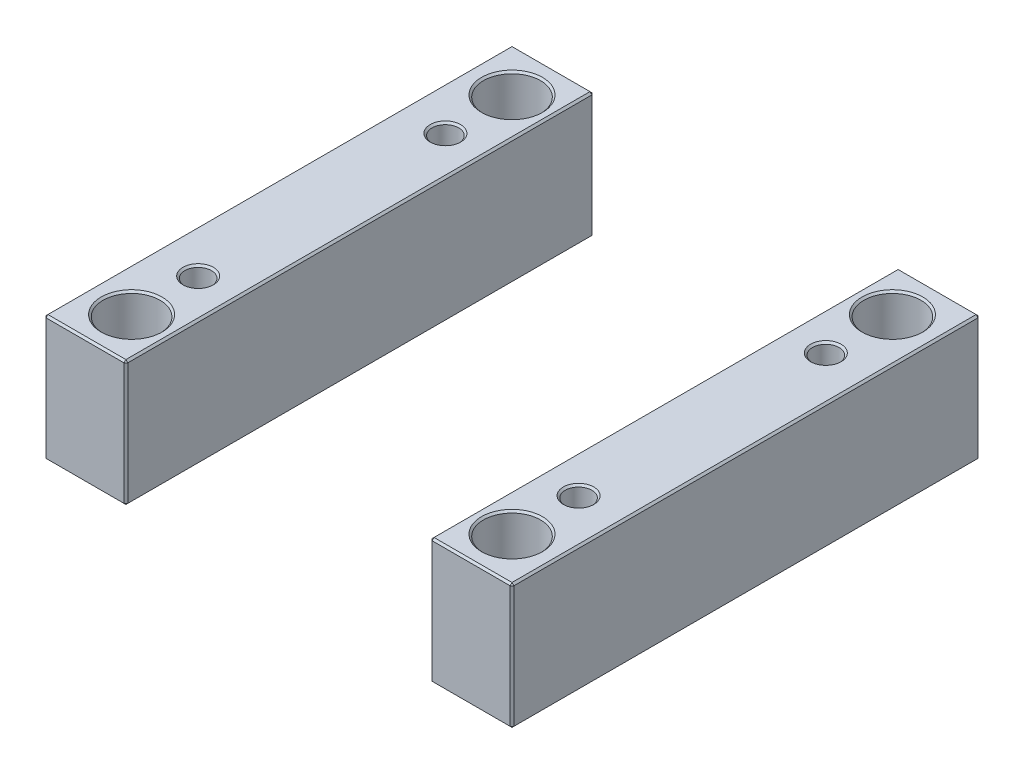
ISO-10303-21;
HEADER;
FILE_DESCRIPTION(('STEP AP214'),'2;1');
FILE_NAME('part.step','',(''),(''),'','','');
FILE_SCHEMA(('AUTOMOTIVE_DESIGN { 1 0 10303 214 1 1 1 1 }'));
ENDSEC;
DATA;
#1=APPLICATION_CONTEXT('core data for automotive mechanical design processes');
#2=APPLICATION_PROTOCOL_DEFINITION('international standard','automotive_design',2000,#1);
#3=PRODUCT_CONTEXT('',#1,'mechanical');
#4=PRODUCT('Part','Part','',(#3));
#5=PRODUCT_RELATED_PRODUCT_CATEGORY('part','',(#4));
#6=PRODUCT_DEFINITION_FORMATION('','',#4);
#7=PRODUCT_DEFINITION_CONTEXT('part definition',#1,'design');
#8=PRODUCT_DEFINITION('design','',#6,#7);
#9=PRODUCT_DEFINITION_SHAPE('','',#8);
#10=(LENGTH_UNIT() NAMED_UNIT(*) SI_UNIT(.MILLI.,.METRE.));
#11=(NAMED_UNIT(*) PLANE_ANGLE_UNIT() SI_UNIT($,.RADIAN.));
#12=(NAMED_UNIT(*) SI_UNIT($,.STERADIAN.) SOLID_ANGLE_UNIT());
#13=UNCERTAINTY_MEASURE_WITH_UNIT(LENGTH_MEASURE(1.E-05),#10,'distance_accuracy_value','');
#14=(GEOMETRIC_REPRESENTATION_CONTEXT(3) GLOBAL_UNCERTAINTY_ASSIGNED_CONTEXT((#13)) GLOBAL_UNIT_ASSIGNED_CONTEXT((#10,
#11,#12)) REPRESENTATION_CONTEXT('',''));
#15=CARTESIAN_POINT('',(0.,0.,0.));
#16=DIRECTION('',(0.,0.,1.));
#17=DIRECTION('',(1.,0.,0.));
#18=AXIS2_PLACEMENT_3D('',#15,#16,#17);
#19=CARTESIAN_POINT('',(-123.,66.,-123.));
#20=DIRECTION('',(0.,0.,1.));
#21=DIRECTION('',(1.,0.,0.));
#22=AXIS2_PLACEMENT_3D('',#19,#20,#21);
#23=PLANE('',#22);
#24=DIRECTION('',(-1.,0.,0.));
#25=VECTOR('',#24,1.);
#26=CARTESIAN_POINT('',(-123.,1.00000000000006,-123.));
#27=LINE('',#26,#25);
#28=CARTESIAN_POINT('',(-81.,1.00000000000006,-123.));
#29=VERTEX_POINT('',#28);
#30=CARTESIAN_POINT('',(-122.,1.00000000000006,-123.));
#31=VERTEX_POINT('',#30);
#32=EDGE_CURVE('P0_E137',#29,#31,#27,.T.);
#33=ORIENTED_EDGE('',*,*,#32,.T.);
#34=DIRECTION('',(0.,1.,0.));
#35=VECTOR('',#34,1.);
#36=CARTESIAN_POINT('',(-122.,66.,-123.));
#37=LINE('',#36,#35);
#38=CARTESIAN_POINT('',(-122.,65.,-123.));
#39=VERTEX_POINT('',#38);
#40=EDGE_CURVE('P0_E265',#31,#39,#37,.T.);
#41=ORIENTED_EDGE('',*,*,#40,.T.);
#42=DIRECTION('',(1.,0.,0.));
#43=VECTOR('',#42,1.);
#44=CARTESIAN_POINT('',(-123.,65.,-123.));
#45=LINE('',#44,#43);
#46=CARTESIAN_POINT('',(-81.,65.,-123.));
#47=VERTEX_POINT('',#46);
#48=EDGE_CURVE('P0_E263',#39,#47,#45,.T.);
#49=ORIENTED_EDGE('',*,*,#48,.T.);
#50=DIRECTION('',(0.,-1.,0.));
#51=VECTOR('',#50,1.);
#52=CARTESIAN_POINT('',(-81.,66.,-123.));
#53=LINE('',#52,#51);
#54=EDGE_CURVE('P0_E260',#47,#29,#53,.T.);
#55=ORIENTED_EDGE('',*,*,#54,.T.);
#56=EDGE_LOOP('',(#33,#41,#49,#55));
#57=FACE_BOUND('',#56,.T.);
#58=ADVANCED_FACE('P0_F16',(#57),#23,.F.);
#59=CARTESIAN_POINT('',(-123.,66.,123.));
#60=DIRECTION('',(1.,0.,0.));
#61=DIRECTION('',(0.,0.,-1.));
#62=AXIS2_PLACEMENT_3D('',#59,#60,#61);
#63=PLANE('',#62);
#64=DIRECTION('',(0.,1.,0.));
#65=VECTOR('',#64,1.);
#66=CARTESIAN_POINT('',(-123.,66.,122.));
#67=LINE('',#66,#65);
#68=CARTESIAN_POINT('',(-123.,1.00000000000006,122.));
#69=VERTEX_POINT('',#68);
#70=CARTESIAN_POINT('',(-123.,65.,122.));
#71=VERTEX_POINT('',#70);
#72=EDGE_CURVE('P0_E253',#69,#71,#67,.T.);
#73=ORIENTED_EDGE('',*,*,#72,.T.);
#74=DIRECTION('',(0.,0.,-1.));
#75=VECTOR('',#74,1.);
#76=CARTESIAN_POINT('',(-123.,65.,123.));
#77=LINE('',#76,#75);
#78=CARTESIAN_POINT('',(-123.,65.,-122.));
#79=VERTEX_POINT('',#78);
#80=EDGE_CURVE('P0_E258',#71,#79,#77,.T.);
#81=ORIENTED_EDGE('',*,*,#80,.T.);
#82=DIRECTION('',(0.,-1.,0.));
#83=VECTOR('',#82,1.);
#84=CARTESIAN_POINT('',(-123.,66.,-122.));
#85=LINE('',#84,#83);
#86=CARTESIAN_POINT('',(-123.,1.00000000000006,-122.));
#87=VERTEX_POINT('',#86);
#88=EDGE_CURVE('P0_E255',#79,#87,#85,.T.);
#89=ORIENTED_EDGE('',*,*,#88,.T.);
#90=DIRECTION('',(0.,0.,1.));
#91=VECTOR('',#90,1.);
#92=CARTESIAN_POINT('',(-123.,1.00000000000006,123.));
#93=LINE('',#92,#91);
#94=EDGE_CURVE('P0_E251',#87,#69,#93,.T.);
#95=ORIENTED_EDGE('',*,*,#94,.T.);
#96=EDGE_LOOP('',(#73,#81,#89,#95));
#97=FACE_BOUND('',#96,.T.);
#98=ADVANCED_FACE('P0_F333',(#97),#63,.F.);
#99=CARTESIAN_POINT('',(-123.,66.,123.));
#100=DIRECTION('',(0.,0.,-1.));
#101=DIRECTION('',(-1.,0.,0.));
#102=AXIS2_PLACEMENT_3D('',#99,#100,#101);
#103=PLANE('',#102);
#104=DIRECTION('',(-1.,0.,0.));
#105=VECTOR('',#104,1.);
#106=CARTESIAN_POINT('',(-123.,65.,123.));
#107=LINE('',#106,#105);
#108=CARTESIAN_POINT('',(-81.,65.,123.));
#109=VERTEX_POINT('',#108);
#110=CARTESIAN_POINT('',(-122.,65.,123.));
#111=VERTEX_POINT('',#110);
#112=EDGE_CURVE('P0_E272',#109,#111,#107,.T.);
#113=ORIENTED_EDGE('',*,*,#112,.T.);
#114=DIRECTION('',(0.,-1.,0.));
#115=VECTOR('',#114,1.);
#116=CARTESIAN_POINT('',(-122.,66.,123.));
#117=LINE('',#116,#115);
#118=CARTESIAN_POINT('',(-122.,1.00000000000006,123.));
#119=VERTEX_POINT('',#118);
#120=EDGE_CURVE('P0_E274',#111,#119,#117,.T.);
#121=ORIENTED_EDGE('',*,*,#120,.T.);
#122=DIRECTION('',(1.,0.,0.));
#123=VECTOR('',#122,1.);
#124=CARTESIAN_POINT('',(-80.,1.00000000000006,123.));
#125=LINE('',#124,#123);
#126=CARTESIAN_POINT('',(-81.,1.00000000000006,123.));
#127=VERTEX_POINT('',#126);
#128=EDGE_CURVE('P0_E270',#119,#127,#125,.T.);
#129=ORIENTED_EDGE('',*,*,#128,.T.);
#130=DIRECTION('',(0.,1.,0.));
#131=VECTOR('',#130,1.);
#132=CARTESIAN_POINT('',(-81.,66.,123.));
#133=LINE('',#132,#131);
#134=EDGE_CURVE('P0_E268',#127,#109,#133,.T.);
#135=ORIENTED_EDGE('',*,*,#134,.T.);
#136=EDGE_LOOP('',(#113,#121,#129,#135));
#137=FACE_BOUND('',#136,.T.);
#138=ADVANCED_FACE('P0_F372',(#137),#103,.F.);
#139=CARTESIAN_POINT('',(-80.,66.,-123.));
#140=DIRECTION('',(-1.,0.,0.));
#141=DIRECTION('',(0.,0.,1.));
#142=AXIS2_PLACEMENT_3D('',#139,#140,#141);
#143=PLANE('',#142);
#144=DIRECTION('',(0.,0.,1.));
#145=VECTOR('',#144,1.);
#146=CARTESIAN_POINT('',(-80.,65.,-123.));
#147=LINE('',#146,#145);
#148=CARTESIAN_POINT('',(-80.,65.,-122.));
#149=VERTEX_POINT('',#148);
#150=CARTESIAN_POINT('',(-80.,65.,122.));
#151=VERTEX_POINT('',#150);
#152=EDGE_CURVE('P0_E31',#149,#151,#147,.T.);
#153=ORIENTED_EDGE('',*,*,#152,.T.);
#154=DIRECTION('',(0.,-1.,0.));
#155=VECTOR('',#154,1.);
#156=CARTESIAN_POINT('',(-80.,66.,122.));
#157=LINE('',#156,#155);
#158=CARTESIAN_POINT('',(-80.,1.00000000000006,122.));
#159=VERTEX_POINT('',#158);
#160=EDGE_CURVE('P0_E190',#151,#159,#157,.T.);
#161=ORIENTED_EDGE('',*,*,#160,.T.);
#162=DIRECTION('',(0.,0.,-1.));
#163=VECTOR('',#162,1.);
#164=CARTESIAN_POINT('',(-80.,1.00000000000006,-123.));
#165=LINE('',#164,#163);
#166=CARTESIAN_POINT('',(-80.,1.00000000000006,-122.));
#167=VERTEX_POINT('',#166);
#168=EDGE_CURVE('P0_E286',#159,#167,#165,.T.);
#169=ORIENTED_EDGE('',*,*,#168,.T.);
#170=DIRECTION('',(0.,1.,0.));
#171=VECTOR('',#170,1.);
#172=CARTESIAN_POINT('',(-80.,66.,-122.));
#173=LINE('',#172,#171);
#174=EDGE_CURVE('P0_E36',#167,#149,#173,.T.);
#175=ORIENTED_EDGE('',*,*,#174,.T.);
#176=EDGE_LOOP('',(#153,#161,#169,#175));
#177=FACE_BOUND('',#176,.T.);
#178=ADVANCED_FACE('P0_F649',(#177),#143,.F.);
#179=CARTESIAN_POINT('',(0.,66.,0.));
#180=DIRECTION('',(0.,-1.,0.));
#181=DIRECTION('',(0.,0.,-1.));
#182=AXIS2_PLACEMENT_3D('',#179,#180,#181);
#183=PLANE('',#182);
#184=CARTESIAN_POINT('',(-100.,66.,-100.));
#185=DIRECTION('',(0.,-1.,0.));
#186=DIRECTION('',(0.,0.,-1.));
#187=AXIS2_PLACEMENT_3D('',#184,#185,#186);
#188=CIRCLE('',#187,16.);
#189=CARTESIAN_POINT('',(-100.,66.,-116.));
#190=VERTEX_POINT('',#189);
#191=EDGE_CURVE('P0_E214',#190,#190,#188,.T.);
#192=ORIENTED_EDGE('',*,*,#191,.T.);
#193=EDGE_LOOP('',(#192));
#194=FACE_BOUND('',#193,.T.);
#195=CARTESIAN_POINT('',(-100.,66.,100.));
#196=DIRECTION('',(0.,-1.,0.));
#197=DIRECTION('',(0.,0.,-1.));
#198=AXIS2_PLACEMENT_3D('',#195,#196,#197);
#199=CIRCLE('',#198,16.);
#200=CARTESIAN_POINT('',(-100.,66.,84.));
#201=VERTEX_POINT('',#200);
#202=EDGE_CURVE('P0_E211',#201,#201,#199,.T.);
#203=ORIENTED_EDGE('',*,*,#202,.T.);
#204=EDGE_LOOP('',(#203));
#205=FACE_BOUND('',#204,.T.);
#206=CARTESIAN_POINT('',(-100.,66.,65.));
#207=DIRECTION('',(0.,-1.,0.));
#208=DIRECTION('',(0.,0.,-1.));
#209=AXIS2_PLACEMENT_3D('',#206,#207,#208);
#210=CIRCLE('',#209,8.);
#211=CARTESIAN_POINT('',(-100.,66.,57.));
#212=VERTEX_POINT('',#211);
#213=EDGE_CURVE('P0_E193',#212,#212,#210,.T.);
#214=ORIENTED_EDGE('',*,*,#213,.T.);
#215=EDGE_LOOP('',(#214));
#216=FACE_BOUND('',#215,.T.);
#217=CARTESIAN_POINT('',(-100.,66.,-65.));
#218=DIRECTION('',(0.,-1.,0.));
#219=DIRECTION('',(0.,0.,-1.));
#220=AXIS2_PLACEMENT_3D('',#217,#218,#219);
#221=CIRCLE('',#220,8.);
#222=CARTESIAN_POINT('',(-100.,66.,-73.));
#223=VERTEX_POINT('',#222);
#224=EDGE_CURVE('P0_E189',#223,#223,#221,.T.);
#225=ORIENTED_EDGE('',*,*,#224,.T.);
#226=EDGE_LOOP('',(#225));
#227=FACE_BOUND('',#226,.T.);
#228=DIRECTION('',(0.,0.,1.));
#229=VECTOR('',#228,1.);
#230=CARTESIAN_POINT('',(-122.,66.,0.));
#231=LINE('',#230,#229);
#232=CARTESIAN_POINT('',(-122.,66.,-122.));
#233=VERTEX_POINT('',#232);
#234=CARTESIAN_POINT('',(-122.,66.,122.));
#235=VERTEX_POINT('',#234);
#236=EDGE_CURVE('P0_E281',#233,#235,#231,.T.);
#237=ORIENTED_EDGE('',*,*,#236,.T.);
#238=DIRECTION('',(1.,0.,0.));
#239=VECTOR('',#238,1.);
#240=CARTESIAN_POINT('',(0.,66.,122.));
#241=LINE('',#240,#239);
#242=CARTESIAN_POINT('',(-81.,66.,122.));
#243=VERTEX_POINT('',#242);
#244=EDGE_CURVE('P0_E283',#235,#243,#241,.T.);
#245=ORIENTED_EDGE('',*,*,#244,.T.);
#246=DIRECTION('',(0.,0.,-1.));
#247=VECTOR('',#246,1.);
#248=CARTESIAN_POINT('',(-81.,66.,0.));
#249=LINE('',#248,#247);
#250=CARTESIAN_POINT('',(-81.,66.,-122.));
#251=VERTEX_POINT('',#250);
#252=EDGE_CURVE('P0_E277',#243,#251,#249,.T.);
#253=ORIENTED_EDGE('',*,*,#252,.T.);
#254=DIRECTION('',(-1.,0.,0.));
#255=VECTOR('',#254,1.);
#256=CARTESIAN_POINT('',(0.,66.,-122.));
#257=LINE('',#256,#255);
#258=EDGE_CURVE('P0_E279',#251,#233,#257,.T.);
#259=ORIENTED_EDGE('',*,*,#258,.T.);
#260=EDGE_LOOP('',(#237,#245,#253,#259));
#261=FACE_BOUND('',#260,.T.);
#262=ADVANCED_FACE('P0_F229',(#194,#205,#216,#227,#261),#183,.F.);
#263=CARTESIAN_POINT('',(0.,0.,0.));
#264=DIRECTION('',(0.,-1.,0.));
#265=DIRECTION('',(0.,0.,-1.));
#266=AXIS2_PLACEMENT_3D('',#263,#264,#265);
#267=PLANE('',#266);
#268=CARTESIAN_POINT('',(-100.,0.,-100.));
#269=DIRECTION('',(0.,-1.,0.));
#270=DIRECTION('',(0.,0.,-1.));
#271=AXIS2_PLACEMENT_3D('',#268,#269,#270);
#272=CIRCLE('',#271,16.);
#273=CARTESIAN_POINT('',(-100.,0.,-116.));
#274=VERTEX_POINT('',#273);
#275=EDGE_CURVE('P0_E202',#274,#274,#272,.F.);
#276=ORIENTED_EDGE('',*,*,#275,.T.);
#277=EDGE_LOOP('',(#276));
#278=FACE_BOUND('',#277,.T.);
#279=CARTESIAN_POINT('',(-100.,0.,100.));
#280=DIRECTION('',(0.,-1.,0.));
#281=DIRECTION('',(0.,0.,-1.));
#282=AXIS2_PLACEMENT_3D('',#279,#280,#281);
#283=CIRCLE('',#282,16.);
#284=CARTESIAN_POINT('',(-100.,0.,84.));
#285=VERTEX_POINT('',#284);
#286=EDGE_CURVE('P0_E199',#285,#285,#283,.F.);
#287=ORIENTED_EDGE('',*,*,#286,.T.);
#288=EDGE_LOOP('',(#287));
#289=FACE_BOUND('',#288,.T.);
#290=CARTESIAN_POINT('',(-100.,0.,-65.));
#291=DIRECTION('',(0.,-1.,0.));
#292=DIRECTION('',(0.,0.,-1.));
#293=AXIS2_PLACEMENT_3D('',#290,#291,#292);
#294=CIRCLE('',#293,8.);
#295=CARTESIAN_POINT('',(-100.,0.,-73.));
#296=VERTEX_POINT('',#295);
#297=EDGE_CURVE('P0_E235',#296,#296,#294,.F.);
#298=ORIENTED_EDGE('',*,*,#297,.T.);
#299=EDGE_LOOP('',(#298));
#300=FACE_BOUND('',#299,.T.);
#301=CARTESIAN_POINT('',(-100.,0.,65.));
#302=DIRECTION('',(0.,-1.,0.));
#303=DIRECTION('',(0.,0.,-1.));
#304=AXIS2_PLACEMENT_3D('',#301,#302,#303);
#305=CIRCLE('',#304,8.);
#306=CARTESIAN_POINT('',(-100.,0.,57.));
#307=VERTEX_POINT('',#306);
#308=EDGE_CURVE('P0_E238',#307,#307,#305,.F.);
#309=ORIENTED_EDGE('',*,*,#308,.T.);
#310=EDGE_LOOP('',(#309));
#311=FACE_BOUND('',#310,.T.);
#312=DIRECTION('',(-1.,0.,0.));
#313=VECTOR('',#312,1.);
#314=CARTESIAN_POINT('',(-123.,0.,122.));
#315=LINE('',#314,#313);
#316=CARTESIAN_POINT('',(-81.,0.,122.));
#317=VERTEX_POINT('',#316);
#318=CARTESIAN_POINT('',(-122.,0.,122.));
#319=VERTEX_POINT('',#318);
#320=EDGE_CURVE('P0_E114',#317,#319,#315,.T.);
#321=ORIENTED_EDGE('',*,*,#320,.T.);
#322=DIRECTION('',(0.,0.,-1.));
#323=VECTOR('',#322,1.);
#324=CARTESIAN_POINT('',(-122.,0.,-123.));
#325=LINE('',#324,#323);
#326=CARTESIAN_POINT('',(-122.,0.,-122.));
#327=VERTEX_POINT('',#326);
#328=EDGE_CURVE('P0_E110',#319,#327,#325,.T.);
#329=ORIENTED_EDGE('',*,*,#328,.T.);
#330=DIRECTION('',(1.,0.,0.));
#331=VECTOR('',#330,1.);
#332=CARTESIAN_POINT('',(-80.,0.,-122.));
#333=LINE('',#332,#331);
#334=CARTESIAN_POINT('',(-81.,0.,-122.));
#335=VERTEX_POINT('',#334);
#336=EDGE_CURVE('P0_E104',#327,#335,#333,.T.);
#337=ORIENTED_EDGE('',*,*,#336,.T.);
#338=DIRECTION('',(0.,0.,1.));
#339=VECTOR('',#338,1.);
#340=CARTESIAN_POINT('',(-81.,0.,123.));
#341=LINE('',#340,#339);
#342=EDGE_CURVE('P0_E107',#335,#317,#341,.T.);
#343=ORIENTED_EDGE('',*,*,#342,.T.);
#344=EDGE_LOOP('',(#321,#329,#337,#343));
#345=FACE_BOUND('',#344,.T.);
#346=ADVANCED_FACE('P0_F106',(#278,#289,#300,#311,#345),#267,.T.);
#347=CARTESIAN_POINT('',(-100.,0.,-65.));
#348=DIRECTION('',(0.,1.,0.));
#349=DIRECTION('',(0.,0.,1.));
#350=AXIS2_PLACEMENT_3D('',#347,#348,#349);
#351=CYLINDRICAL_SURFACE('',#350,7.);
#352=CARTESIAN_POINT('',(-100.,65.,-65.));
#353=DIRECTION('',(0.,-1.,0.));
#354=DIRECTION('',(0.,0.,-1.));
#355=AXIS2_PLACEMENT_3D('',#352,#353,#354);
#356=CIRCLE('',#355,7.);
#357=CARTESIAN_POINT('',(-100.,65.,-72.));
#358=VERTEX_POINT('',#357);
#359=EDGE_CURVE('P0_E196',#358,#358,#356,.F.);
#360=ORIENTED_EDGE('',*,*,#359,.T.);
#361=EDGE_LOOP('',(#360));
#362=FACE_BOUND('',#361,.T.);
#363=CARTESIAN_POINT('',(-100.,0.999999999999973,-65.));
#364=DIRECTION('',(0.,-1.,0.));
#365=DIRECTION('',(0.,0.,-1.));
#366=AXIS2_PLACEMENT_3D('',#363,#364,#365);
#367=CIRCLE('',#366,7.);
#368=CARTESIAN_POINT('',(-100.,0.999999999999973,-72.));
#369=VERTEX_POINT('',#368);
#370=EDGE_CURVE('P0_E241',#369,#369,#367,.T.);
#371=ORIENTED_EDGE('',*,*,#370,.T.);
#372=EDGE_LOOP('',(#371));
#373=FACE_BOUND('',#372,.T.);
#374=ADVANCED_FACE('P0_F228',(#362,#373),#351,.F.);
#375=CARTESIAN_POINT('',(-100.,0.,65.));
#376=DIRECTION('',(0.,1.,0.));
#377=DIRECTION('',(0.,0.,1.));
#378=AXIS2_PLACEMENT_3D('',#375,#376,#377);
#379=CYLINDRICAL_SURFACE('',#378,7.);
#380=CARTESIAN_POINT('',(-100.,65.,65.));
#381=DIRECTION('',(0.,-1.,0.));
#382=DIRECTION('',(0.,0.,-1.));
#383=AXIS2_PLACEMENT_3D('',#380,#381,#382);
#384=CIRCLE('',#383,7.);
#385=CARTESIAN_POINT('',(-100.,65.,58.));
#386=VERTEX_POINT('',#385);
#387=EDGE_CURVE('P0_E186',#386,#386,#384,.F.);
#388=ORIENTED_EDGE('',*,*,#387,.T.);
#389=EDGE_LOOP('',(#388));
#390=FACE_BOUND('',#389,.T.);
#391=CARTESIAN_POINT('',(-100.,1.00000000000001,65.));
#392=DIRECTION('',(0.,-1.,0.));
#393=DIRECTION('',(0.,0.,-1.));
#394=AXIS2_PLACEMENT_3D('',#391,#392,#393);
#395=CIRCLE('',#394,7.);
#396=CARTESIAN_POINT('',(-100.,1.00000000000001,58.));
#397=VERTEX_POINT('',#396);
#398=EDGE_CURVE('P0_E248',#397,#397,#395,.T.);
#399=ORIENTED_EDGE('',*,*,#398,.T.);
#400=EDGE_LOOP('',(#399));
#401=FACE_BOUND('',#400,.T.);
#402=ADVANCED_FACE('P0_F380',(#390,#401),#379,.F.);
#403=CARTESIAN_POINT('',(-100.,0.,-65.));
#404=DIRECTION('',(0.,-1.,0.));
#405=DIRECTION('',(0.,0.,-1.));
#406=AXIS2_PLACEMENT_3D('',#403,#404,#405);
#407=CONICAL_SURFACE('',#406,8.,0.78539816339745);
#408=ORIENTED_EDGE('',*,*,#370,.F.);
#409=EDGE_LOOP('',(#408));
#410=FACE_BOUND('',#409,.T.);
#411=ORIENTED_EDGE('',*,*,#297,.F.);
#412=EDGE_LOOP('',(#411));
#413=FACE_BOUND('',#412,.T.);
#414=ADVANCED_FACE('P0_F376',(#410,#413),#407,.F.);
#415=CARTESIAN_POINT('',(-100.,0.,65.));
#416=DIRECTION('',(0.,-1.,0.));
#417=DIRECTION('',(0.,0.,-1.));
#418=AXIS2_PLACEMENT_3D('',#415,#416,#417);
#419=CONICAL_SURFACE('',#418,8.,0.785398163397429);
#420=ORIENTED_EDGE('',*,*,#398,.F.);
#421=EDGE_LOOP('',(#420));
#422=FACE_BOUND('',#421,.T.);
#423=ORIENTED_EDGE('',*,*,#308,.F.);
#424=EDGE_LOOP('',(#423));
#425=FACE_BOUND('',#424,.T.);
#426=ADVANCED_FACE('P0_F379',(#422,#425),#419,.F.);
#427=CARTESIAN_POINT('',(-80.,66.,122.));
#428=DIRECTION('',(-0.707106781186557,0.,-0.707106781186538));
#429=DIRECTION('',(0.,-1.,0.));
#430=AXIS2_PLACEMENT_3D('',#427,#428,#429);
#431=PLANE('',#430);
#432=DIRECTION('',(-0.707106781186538,0.,0.707106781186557));
#433=VECTOR('',#432,1.);
#434=CARTESIAN_POINT('',(-80.5,65.,122.5));
#435=LINE('',#434,#433);
#436=EDGE_CURVE('P0_E125',#109,#151,#435,.F.);
#437=ORIENTED_EDGE('',*,*,#436,.F.);
#438=ORIENTED_EDGE('',*,*,#134,.F.);
#439=DIRECTION('',(0.707106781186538,0.,-0.707106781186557));
#440=VECTOR('',#439,1.);
#441=CARTESIAN_POINT('',(-81.,1.00000000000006,123.));
#442=LINE('',#441,#440);
#443=EDGE_CURVE('P0_E181',#159,#127,#442,.F.);
#444=ORIENTED_EDGE('',*,*,#443,.F.);
#445=ORIENTED_EDGE('',*,*,#160,.F.);
#446=EDGE_LOOP('',(#437,#438,#444,#445));
#447=FACE_BOUND('',#446,.T.);
#448=ADVANCED_FACE('P0_F384',(#447),#431,.F.);
#449=CARTESIAN_POINT('',(-81.,66.,122.));
#450=DIRECTION('',(0.577350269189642,0.577350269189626,0.57735026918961));
#451=DIRECTION('',(-0.707106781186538,0.707106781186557,0.));
#452=AXIS2_PLACEMENT_3D('',#449,#450,#451);
#453=PLANE('',#452);
#454=DIRECTION('',(0.,0.707106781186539,-0.707106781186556));
#455=VECTOR('',#454,1.);
#456=CARTESIAN_POINT('',(-81.,66.,122.));
#457=LINE('',#456,#455);
#458=EDGE_CURVE('P0_E175',#109,#243,#457,.T.);
#459=ORIENTED_EDGE('',*,*,#458,.F.);
#460=ORIENTED_EDGE('',*,*,#436,.T.);
#461=DIRECTION('',(0.707106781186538,-0.707106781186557,0.));
#462=VECTOR('',#461,1.);
#463=CARTESIAN_POINT('',(-81.,66.,122.));
#464=LINE('',#463,#462);
#465=EDGE_CURVE('P0_E178',#243,#151,#464,.T.);
#466=ORIENTED_EDGE('',*,*,#465,.F.);
#467=EDGE_LOOP('',(#459,#460,#466));
#468=FACE_BOUND('',#467,.T.);
#469=ADVANCED_FACE('P0_F588',(#468),#453,.T.);
#470=CARTESIAN_POINT('',(-81.,1.00000000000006,123.));
#471=DIRECTION('',(0.577350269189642,-0.57735026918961,0.577350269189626));
#472=DIRECTION('',(0.707106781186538,0.,-0.707106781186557));
#473=AXIS2_PLACEMENT_3D('',#470,#471,#472);
#474=PLANE('',#473);
#475=DIRECTION('',(0.707106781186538,0.707106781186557,0.));
#476=VECTOR('',#475,1.);
#477=CARTESIAN_POINT('',(-80.5,0.500000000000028,122.));
#478=LINE('',#477,#476);
#479=EDGE_CURVE('P0_E123',#159,#317,#478,.F.);
#480=ORIENTED_EDGE('',*,*,#479,.F.);
#481=ORIENTED_EDGE('',*,*,#443,.T.);
#482=DIRECTION('',(0.,-0.707106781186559,-0.707106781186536));
#483=VECTOR('',#482,1.);
#484=CARTESIAN_POINT('',(-81.,1.00000000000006,123.));
#485=LINE('',#484,#483);
#486=EDGE_CURVE('P0_E172',#317,#127,#485,.F.);
#487=ORIENTED_EDGE('',*,*,#486,.F.);
#488=EDGE_LOOP('',(#480,#481,#487));
#489=FACE_BOUND('',#488,.T.);
#490=ADVANCED_FACE('P0_F597',(#489),#474,.T.);
#491=CARTESIAN_POINT('',(-81.,66.,0.));
#492=DIRECTION('',(-0.707106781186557,-0.707106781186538,0.));
#493=DIRECTION('',(0.,0.,-1.));
#494=AXIS2_PLACEMENT_3D('',#491,#492,#493);
#495=PLANE('',#494);
#496=ORIENTED_EDGE('',*,*,#465,.T.);
#497=ORIENTED_EDGE('',*,*,#152,.F.);
#498=DIRECTION('',(-0.707106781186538,0.707106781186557,0.));
#499=VECTOR('',#498,1.);
#500=CARTESIAN_POINT('',(-80.5,65.5,-122.));
#501=LINE('',#500,#499);
#502=EDGE_CURVE('P0_E165',#251,#149,#501,.F.);
#503=ORIENTED_EDGE('',*,*,#502,.F.);
#504=ORIENTED_EDGE('',*,*,#252,.F.);
#505=EDGE_LOOP('',(#496,#497,#503,#504));
#506=FACE_BOUND('',#505,.T.);
#507=ADVANCED_FACE('P0_F349',(#506),#495,.F.);
#508=CARTESIAN_POINT('',(0.,66.,122.));
#509=DIRECTION('',(0.,-0.707106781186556,-0.707106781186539));
#510=DIRECTION('',(1.,0.,0.));
#511=AXIS2_PLACEMENT_3D('',#508,#509,#510);
#512=PLANE('',#511);
#513=ORIENTED_EDGE('',*,*,#458,.T.);
#514=ORIENTED_EDGE('',*,*,#244,.F.);
#515=DIRECTION('',(0.,-0.707106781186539,0.707106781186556));
#516=VECTOR('',#515,1.);
#517=CARTESIAN_POINT('',(-122.,65.5,122.5));
#518=LINE('',#517,#516);
#519=EDGE_CURVE('P0_E162',#111,#235,#518,.F.);
#520=ORIENTED_EDGE('',*,*,#519,.F.);
#521=ORIENTED_EDGE('',*,*,#112,.F.);
#522=EDGE_LOOP('',(#513,#514,#520,#521));
#523=FACE_BOUND('',#522,.T.);
#524=ADVANCED_FACE('P0_F344',(#523),#512,.F.);
#525=CARTESIAN_POINT('',(-122.,66.,123.));
#526=DIRECTION('',(0.707106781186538,0.,-0.707106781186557));
#527=DIRECTION('',(0.,-1.,0.));
#528=AXIS2_PLACEMENT_3D('',#525,#526,#527);
#529=PLANE('',#528);
#530=DIRECTION('',(0.707106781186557,0.,0.707106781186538));
#531=VECTOR('',#530,1.);
#532=CARTESIAN_POINT('',(-122.,1.00000000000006,123.));
#533=LINE('',#532,#531);
#534=EDGE_CURVE('P0_E156',#119,#69,#533,.F.);
#535=ORIENTED_EDGE('',*,*,#534,.F.);
#536=ORIENTED_EDGE('',*,*,#120,.F.);
#537=DIRECTION('',(-0.707106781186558,0.,-0.707106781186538));
#538=VECTOR('',#537,1.);
#539=CARTESIAN_POINT('',(-123.,65.,122.));
#540=LINE('',#539,#538);
#541=EDGE_CURVE('P0_E159',#71,#111,#540,.F.);
#542=ORIENTED_EDGE('',*,*,#541,.F.);
#543=ORIENTED_EDGE('',*,*,#72,.F.);
#544=EDGE_LOOP('',(#535,#536,#542,#543));
#545=FACE_BOUND('',#544,.T.);
#546=ADVANCED_FACE('P0_F338',(#545),#529,.F.);
#547=CARTESIAN_POINT('',(-123.,1.00000000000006,123.));
#548=DIRECTION('',(0.,-0.707106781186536,0.707106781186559));
#549=DIRECTION('',(-1.,0.,0.));
#550=AXIS2_PLACEMENT_3D('',#547,#548,#549);
#551=PLANE('',#550);
#552=ORIENTED_EDGE('',*,*,#486,.T.);
#553=ORIENTED_EDGE('',*,*,#128,.F.);
#554=DIRECTION('',(0.,0.707106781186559,0.707106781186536));
#555=VECTOR('',#554,1.);
#556=CARTESIAN_POINT('',(-122.,1.00000000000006,123.));
#557=LINE('',#556,#555);
#558=EDGE_CURVE('P0_E134',#319,#119,#557,.T.);
#559=ORIENTED_EDGE('',*,*,#558,.F.);
#560=ORIENTED_EDGE('',*,*,#320,.F.);
#561=EDGE_LOOP('',(#552,#553,#559,#560));
#562=FACE_BOUND('',#561,.T.);
#563=ADVANCED_FACE('P0_F364',(#562),#551,.T.);
#564=CARTESIAN_POINT('',(-80.,1.00000000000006,-123.));
#565=DIRECTION('',(0.707106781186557,-0.707106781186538,0.));
#566=DIRECTION('',(0.,0.,1.));
#567=AXIS2_PLACEMENT_3D('',#564,#565,#566);
#568=PLANE('',#567);
#569=ORIENTED_EDGE('',*,*,#479,.T.);
#570=ORIENTED_EDGE('',*,*,#342,.F.);
#571=DIRECTION('',(-0.707106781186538,-0.707106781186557,0.));
#572=VECTOR('',#571,1.);
#573=CARTESIAN_POINT('',(-81.,0.,-122.));
#574=LINE('',#573,#572);
#575=EDGE_CURVE('P0_E120',#167,#335,#574,.T.);
#576=ORIENTED_EDGE('',*,*,#575,.F.);
#577=ORIENTED_EDGE('',*,*,#168,.F.);
#578=EDGE_LOOP('',(#569,#570,#576,#577));
#579=FACE_BOUND('',#578,.T.);
#580=ADVANCED_FACE('P0_F119',(#579),#568,.T.);
#581=CARTESIAN_POINT('',(-81.,66.,-123.));
#582=DIRECTION('',(-0.707106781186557,0.,0.707106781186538));
#583=DIRECTION('',(0.,-1.,0.));
#584=AXIS2_PLACEMENT_3D('',#581,#582,#583);
#585=PLANE('',#584);
#586=DIRECTION('',(0.707106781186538,0.,0.707106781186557));
#587=VECTOR('',#586,1.);
#588=CARTESIAN_POINT('',(-81.,65.,-123.));
#589=LINE('',#588,#587);
#590=EDGE_CURVE('P0_E168',#149,#47,#589,.F.);
#591=ORIENTED_EDGE('',*,*,#590,.F.);
#592=ORIENTED_EDGE('',*,*,#174,.F.);
#593=DIRECTION('',(-0.707106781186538,0.,-0.707106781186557));
#594=VECTOR('',#593,1.);
#595=CARTESIAN_POINT('',(-80.5,1.00000000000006,-122.5));
#596=LINE('',#595,#594);
#597=EDGE_CURVE('P0_E133',#29,#167,#596,.F.);
#598=ORIENTED_EDGE('',*,*,#597,.F.);
#599=ORIENTED_EDGE('',*,*,#54,.F.);
#600=EDGE_LOOP('',(#591,#592,#598,#599));
#601=FACE_BOUND('',#600,.T.);
#602=ADVANCED_FACE('P0_F354',(#601),#585,.F.);
#603=CARTESIAN_POINT('',(-81.,65.,-123.));
#604=DIRECTION('',(0.577350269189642,0.577350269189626,-0.57735026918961));
#605=DIRECTION('',(-0.707106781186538,0.707106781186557,0.));
#606=AXIS2_PLACEMENT_3D('',#603,#604,#605);
#607=PLANE('',#606);
#608=ORIENTED_EDGE('',*,*,#502,.T.);
#609=ORIENTED_EDGE('',*,*,#590,.T.);
#610=DIRECTION('',(0.,-0.707106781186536,-0.707106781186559));
#611=VECTOR('',#610,1.);
#612=CARTESIAN_POINT('',(-81.,65.,-123.));
#613=LINE('',#612,#611);
#614=EDGE_CURVE('P0_E151',#251,#47,#613,.T.);
#615=ORIENTED_EDGE('',*,*,#614,.F.);
#616=EDGE_LOOP('',(#608,#609,#615));
#617=FACE_BOUND('',#616,.T.);
#618=ADVANCED_FACE('P0_F352',(#617),#607,.T.);
#619=CARTESIAN_POINT('',(-123.,65.,122.));
#620=DIRECTION('',(-0.57735026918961,0.577350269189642,0.577350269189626));
#621=DIRECTION('',(0.,-0.707106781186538,0.707106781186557));
#622=AXIS2_PLACEMENT_3D('',#619,#620,#621);
#623=PLANE('',#622);
#624=ORIENTED_EDGE('',*,*,#541,.T.);
#625=ORIENTED_EDGE('',*,*,#519,.T.);
#626=DIRECTION('',(0.707106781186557,0.707106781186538,0.));
#627=VECTOR('',#626,1.);
#628=CARTESIAN_POINT('',(-123.,65.,122.));
#629=LINE('',#628,#627);
#630=EDGE_CURVE('P0_E142',#71,#235,#629,.T.);
#631=ORIENTED_EDGE('',*,*,#630,.F.);
#632=EDGE_LOOP('',(#624,#625,#631));
#633=FACE_BOUND('',#632,.T.);
#634=ADVANCED_FACE('P0_F341',(#633),#623,.T.);
#635=CARTESIAN_POINT('',(-122.,1.00000000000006,123.));
#636=DIRECTION('',(-0.577350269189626,-0.57735026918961,0.577350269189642));
#637=DIRECTION('',(0.707106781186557,0.,0.707106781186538));
#638=AXIS2_PLACEMENT_3D('',#635,#636,#637);
#639=PLANE('',#638);
#640=ORIENTED_EDGE('',*,*,#558,.T.);
#641=ORIENTED_EDGE('',*,*,#534,.T.);
#642=DIRECTION('',(0.707106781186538,-0.707106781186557,0.));
#643=VECTOR('',#642,1.);
#644=CARTESIAN_POINT('',(-122.5,0.500000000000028,122.));
#645=LINE('',#644,#643);
#646=EDGE_CURVE('P0_E138',#319,#69,#645,.F.);
#647=ORIENTED_EDGE('',*,*,#646,.F.);
#648=EDGE_LOOP('',(#640,#641,#647));
#649=FACE_BOUND('',#648,.T.);
#650=ADVANCED_FACE('P0_F403',(#649),#639,.T.);
#651=CARTESIAN_POINT('',(-81.,0.,-122.));
#652=DIRECTION('',(0.577350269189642,-0.57735026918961,-0.577350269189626));
#653=DIRECTION('',(-0.707106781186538,0.,-0.707106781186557));
#654=AXIS2_PLACEMENT_3D('',#651,#652,#653);
#655=PLANE('',#654);
#656=ORIENTED_EDGE('',*,*,#597,.T.);
#657=ORIENTED_EDGE('',*,*,#575,.T.);
#658=DIRECTION('',(0.,0.707106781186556,-0.707106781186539));
#659=VECTOR('',#658,1.);
#660=CARTESIAN_POINT('',(-81.,0.,-122.));
#661=LINE('',#660,#659);
#662=EDGE_CURVE('P0_E130',#29,#335,#661,.F.);
#663=ORIENTED_EDGE('',*,*,#662,.F.);
#664=EDGE_LOOP('',(#656,#657,#663));
#665=FACE_BOUND('',#664,.T.);
#666=ADVANCED_FACE('P0_F129',(#665),#655,.T.);
#667=CARTESIAN_POINT('',(0.,66.,-122.));
#668=DIRECTION('',(0.,-0.707106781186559,0.707106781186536));
#669=DIRECTION('',(-1.,0.,0.));
#670=AXIS2_PLACEMENT_3D('',#667,#668,#669);
#671=PLANE('',#670);
#672=ORIENTED_EDGE('',*,*,#614,.T.);
#673=ORIENTED_EDGE('',*,*,#48,.F.);
#674=DIRECTION('',(0.,0.707106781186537,0.707106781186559));
#675=VECTOR('',#674,1.);
#676=CARTESIAN_POINT('',(-122.,65.,-123.));
#677=LINE('',#676,#675);
#678=EDGE_CURVE('P0_E139',#233,#39,#677,.F.);
#679=ORIENTED_EDGE('',*,*,#678,.F.);
#680=ORIENTED_EDGE('',*,*,#258,.F.);
#681=EDGE_LOOP('',(#672,#673,#679,#680));
#682=FACE_BOUND('',#681,.T.);
#683=ADVANCED_FACE('P0_F316',(#682),#671,.F.);
#684=CARTESIAN_POINT('',(-122.,66.,0.));
#685=DIRECTION('',(0.707106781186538,-0.707106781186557,0.));
#686=DIRECTION('',(0.,0.,1.));
#687=AXIS2_PLACEMENT_3D('',#684,#685,#686);
#688=PLANE('',#687);
#689=ORIENTED_EDGE('',*,*,#630,.T.);
#690=ORIENTED_EDGE('',*,*,#236,.F.);
#691=DIRECTION('',(-0.707106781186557,-0.707106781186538,0.));
#692=VECTOR('',#691,1.);
#693=CARTESIAN_POINT('',(-122.5,65.5,-122.));
#694=LINE('',#693,#692);
#695=EDGE_CURVE('P0_E145',#79,#233,#694,.F.);
#696=ORIENTED_EDGE('',*,*,#695,.F.);
#697=ORIENTED_EDGE('',*,*,#80,.F.);
#698=EDGE_LOOP('',(#689,#690,#696,#697));
#699=FACE_BOUND('',#698,.T.);
#700=ADVANCED_FACE('P0_F310',(#699),#688,.F.);
#701=CARTESIAN_POINT('',(-123.,1.00000000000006,123.));
#702=DIRECTION('',(-0.707106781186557,-0.707106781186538,0.));
#703=DIRECTION('',(0.,0.,-1.));
#704=AXIS2_PLACEMENT_3D('',#701,#702,#703);
#705=PLANE('',#704);
#706=ORIENTED_EDGE('',*,*,#646,.T.);
#707=ORIENTED_EDGE('',*,*,#94,.F.);
#708=DIRECTION('',(-0.707106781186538,0.707106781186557,0.));
#709=VECTOR('',#708,1.);
#710=CARTESIAN_POINT('',(-123.,1.00000000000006,-122.));
#711=LINE('',#710,#709);
#712=EDGE_CURVE('P0_E297',#327,#87,#711,.T.);
#713=ORIENTED_EDGE('',*,*,#712,.F.);
#714=ORIENTED_EDGE('',*,*,#328,.F.);
#715=EDGE_LOOP('',(#706,#707,#713,#714));
#716=FACE_BOUND('',#715,.T.);
#717=ADVANCED_FACE('P0_F329',(#716),#705,.T.);
#718=CARTESIAN_POINT('',(-123.,1.00000000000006,-123.));
#719=DIRECTION('',(0.,-0.707106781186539,-0.707106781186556));
#720=DIRECTION('',(1.,0.,0.));
#721=AXIS2_PLACEMENT_3D('',#718,#719,#720);
#722=PLANE('',#721);
#723=ORIENTED_EDGE('',*,*,#662,.T.);
#724=ORIENTED_EDGE('',*,*,#336,.F.);
#725=DIRECTION('',(0.,-0.707106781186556,0.707106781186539));
#726=VECTOR('',#725,1.);
#727=CARTESIAN_POINT('',(-122.,0.500000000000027,-122.5));
#728=LINE('',#727,#726);
#729=EDGE_CURVE('P0_E295',#31,#327,#728,.T.);
#730=ORIENTED_EDGE('',*,*,#729,.F.);
#731=ORIENTED_EDGE('',*,*,#32,.F.);
#732=EDGE_LOOP('',(#723,#724,#730,#731));
#733=FACE_BOUND('',#732,.T.);
#734=ADVANCED_FACE('P0_F136',(#733),#722,.T.);
#735=CARTESIAN_POINT('',(-122.,65.,-123.));
#736=DIRECTION('',(-0.577350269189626,0.577350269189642,-0.57735026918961));
#737=DIRECTION('',(-0.707106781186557,-0.707106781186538,0.));
#738=AXIS2_PLACEMENT_3D('',#735,#736,#737);
#739=PLANE('',#738);
#740=ORIENTED_EDGE('',*,*,#695,.T.);
#741=ORIENTED_EDGE('',*,*,#678,.T.);
#742=DIRECTION('',(0.707106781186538,0.,-0.707106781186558));
#743=VECTOR('',#742,1.);
#744=CARTESIAN_POINT('',(-122.,65.,-123.));
#745=LINE('',#744,#743);
#746=EDGE_CURVE('P0_E293',#79,#39,#745,.T.);
#747=ORIENTED_EDGE('',*,*,#746,.F.);
#748=EDGE_LOOP('',(#740,#741,#747));
#749=FACE_BOUND('',#748,.T.);
#750=ADVANCED_FACE('P0_F303',(#749),#739,.T.);
#751=CARTESIAN_POINT('',(-123.,1.00000000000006,-122.));
#752=DIRECTION('',(-0.577350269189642,-0.57735026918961,-0.577350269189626));
#753=DIRECTION('',(-0.707106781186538,0.,0.707106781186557));
#754=AXIS2_PLACEMENT_3D('',#751,#752,#753);
#755=PLANE('',#754);
#756=ORIENTED_EDGE('',*,*,#729,.T.);
#757=ORIENTED_EDGE('',*,*,#712,.T.);
#758=DIRECTION('',(-0.707106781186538,0.,0.707106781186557));
#759=VECTOR('',#758,1.);
#760=CARTESIAN_POINT('',(-123.,1.00000000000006,-122.));
#761=LINE('',#760,#759);
#762=EDGE_CURVE('P0_E291',#31,#87,#761,.T.);
#763=ORIENTED_EDGE('',*,*,#762,.F.);
#764=EDGE_LOOP('',(#756,#757,#763));
#765=FACE_BOUND('',#764,.T.);
#766=ADVANCED_FACE('P0_F325',(#765),#755,.T.);
#767=CARTESIAN_POINT('',(-123.,66.,-122.));
#768=DIRECTION('',(0.707106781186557,0.,0.707106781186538));
#769=DIRECTION('',(0.,-1.,0.));
#770=AXIS2_PLACEMENT_3D('',#767,#768,#769);
#771=PLANE('',#770);
#772=ORIENTED_EDGE('',*,*,#746,.T.);
#773=ORIENTED_EDGE('',*,*,#40,.F.);
#774=ORIENTED_EDGE('',*,*,#762,.T.);
#775=ORIENTED_EDGE('',*,*,#88,.F.);
#776=EDGE_LOOP('',(#772,#773,#774,#775));
#777=FACE_BOUND('',#776,.T.);
#778=ADVANCED_FACE('P0_F323',(#777),#771,.F.);
#779=CARTESIAN_POINT('',(-100.,65.,65.));
#780=DIRECTION('',(0.,1.,0.));
#781=DIRECTION('',(0.,0.,1.));
#782=AXIS2_PLACEMENT_3D('',#779,#780,#781);
#783=CONICAL_SURFACE('',#782,7.,0.785398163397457);
#784=ORIENTED_EDGE('',*,*,#213,.F.);
#785=EDGE_LOOP('',(#784));
#786=FACE_BOUND('',#785,.T.);
#787=ORIENTED_EDGE('',*,*,#387,.F.);
#788=EDGE_LOOP('',(#787));
#789=FACE_BOUND('',#788,.T.);
#790=ADVANCED_FACE('P0_F388',(#786,#789),#783,.F.);
#791=CARTESIAN_POINT('',(-100.,65.,-65.));
#792=DIRECTION('',(0.,1.,0.));
#793=DIRECTION('',(0.,0.,1.));
#794=AXIS2_PLACEMENT_3D('',#791,#792,#793);
#795=CONICAL_SURFACE('',#794,7.,0.785398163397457);
#796=ORIENTED_EDGE('',*,*,#224,.F.);
#797=EDGE_LOOP('',(#796));
#798=FACE_BOUND('',#797,.T.);
#799=ORIENTED_EDGE('',*,*,#359,.F.);
#800=EDGE_LOOP('',(#799));
#801=FACE_BOUND('',#800,.T.);
#802=ADVANCED_FACE('P0_F470',(#798,#801),#795,.F.);
#803=CARTESIAN_POINT('',(-100.,0.,100.));
#804=DIRECTION('',(0.,1.,0.));
#805=DIRECTION('',(0.,0.,1.));
#806=AXIS2_PLACEMENT_3D('',#803,#804,#805);
#807=CYLINDRICAL_SURFACE('',#806,15.);
#808=CARTESIAN_POINT('',(-100.,65.,100.));
#809=DIRECTION('',(0.,-1.,0.));
#810=DIRECTION('',(0.,0.,-1.));
#811=AXIS2_PLACEMENT_3D('',#808,#809,#810);
#812=CIRCLE('',#811,15.);
#813=CARTESIAN_POINT('',(-100.,65.,85.));
#814=VERTEX_POINT('',#813);
#815=EDGE_CURVE('P0_E10',#814,#814,#812,.F.);
#816=ORIENTED_EDGE('',*,*,#815,.T.);
#817=EDGE_LOOP('',(#816));
#818=FACE_BOUND('',#817,.T.);
#819=CARTESIAN_POINT('',(-100.,1.00000000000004,100.));
#820=DIRECTION('',(0.,-1.,0.));
#821=DIRECTION('',(0.,0.,-1.));
#822=AXIS2_PLACEMENT_3D('',#819,#820,#821);
#823=CIRCLE('',#822,15.);
#824=CARTESIAN_POINT('',(-100.,1.00000000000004,85.));
#825=VERTEX_POINT('',#824);
#826=EDGE_CURVE('P0_E24',#825,#825,#823,.T.);
#827=ORIENTED_EDGE('',*,*,#826,.T.);
#828=EDGE_LOOP('',(#827));
#829=FACE_BOUND('',#828,.T.);
#830=ADVANCED_FACE('P0_F219',(#818,#829),#807,.F.);
#831=CARTESIAN_POINT('',(-100.,0.,-100.));
#832=DIRECTION('',(0.,1.,0.));
#833=DIRECTION('',(0.,0.,1.));
#834=AXIS2_PLACEMENT_3D('',#831,#832,#833);
#835=CYLINDRICAL_SURFACE('',#834,15.);
#836=CARTESIAN_POINT('',(-100.,0.999999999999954,-100.));
#837=DIRECTION('',(0.,-1.,0.));
#838=DIRECTION('',(0.,0.,-1.));
#839=AXIS2_PLACEMENT_3D('',#836,#837,#838);
#840=CIRCLE('',#839,15.);
#841=CARTESIAN_POINT('',(-100.,0.999999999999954,-115.));
#842=VERTEX_POINT('',#841);
#843=EDGE_CURVE('P0_E208',#842,#842,#840,.T.);
#844=ORIENTED_EDGE('',*,*,#843,.T.);
#845=EDGE_LOOP('',(#844));
#846=FACE_BOUND('',#845,.T.);
#847=CARTESIAN_POINT('',(-100.,65.,-100.));
#848=DIRECTION('',(0.,-1.,0.));
#849=DIRECTION('',(0.,0.,-1.));
#850=AXIS2_PLACEMENT_3D('',#847,#848,#849);
#851=CIRCLE('',#850,15.);
#852=CARTESIAN_POINT('',(-100.,65.,-115.));
#853=VERTEX_POINT('',#852);
#854=EDGE_CURVE('P0_E205',#853,#853,#851,.F.);
#855=ORIENTED_EDGE('',*,*,#854,.T.);
#856=EDGE_LOOP('',(#855));
#857=FACE_BOUND('',#856,.T.);
#858=ADVANCED_FACE('P0_F487',(#846,#857),#835,.F.);
#859=CARTESIAN_POINT('',(-100.,0.,-100.));
#860=DIRECTION('',(0.,-1.,0.));
#861=DIRECTION('',(0.,0.,-1.));
#862=AXIS2_PLACEMENT_3D('',#859,#860,#861);
#863=CONICAL_SURFACE('',#862,16.,0.785398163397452);
#864=ORIENTED_EDGE('',*,*,#843,.F.);
#865=EDGE_LOOP('',(#864));
#866=FACE_BOUND('',#865,.T.);
#867=ORIENTED_EDGE('',*,*,#275,.F.);
#868=EDGE_LOOP('',(#867));
#869=FACE_BOUND('',#868,.T.);
#870=ADVANCED_FACE('P0_F496',(#866,#869),#863,.F.);
#871=CARTESIAN_POINT('',(-100.,65.,-100.));
#872=DIRECTION('',(0.,1.,0.));
#873=DIRECTION('',(0.,0.,1.));
#874=AXIS2_PLACEMENT_3D('',#871,#872,#873);
#875=CONICAL_SURFACE('',#874,15.,0.785398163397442);
#876=ORIENTED_EDGE('',*,*,#191,.F.);
#877=EDGE_LOOP('',(#876));
#878=FACE_BOUND('',#877,.T.);
#879=ORIENTED_EDGE('',*,*,#854,.F.);
#880=EDGE_LOOP('',(#879));
#881=FACE_BOUND('',#880,.T.);
#882=ADVANCED_FACE('P0_F505',(#878,#881),#875,.F.);
#883=CARTESIAN_POINT('',(-100.,65.,100.));
#884=DIRECTION('',(0.,1.,0.));
#885=DIRECTION('',(0.,0.,1.));
#886=AXIS2_PLACEMENT_3D('',#883,#884,#885);
#887=CONICAL_SURFACE('',#886,15.,0.785398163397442);
#888=ORIENTED_EDGE('',*,*,#202,.F.);
#889=EDGE_LOOP('',(#888));
#890=FACE_BOUND('',#889,.T.);
#891=ORIENTED_EDGE('',*,*,#815,.F.);
#892=EDGE_LOOP('',(#891));
#893=FACE_BOUND('',#892,.T.);
#894=ADVANCED_FACE('P0_F223',(#890,#893),#887,.F.);
#895=CARTESIAN_POINT('',(-100.,0.,100.));
#896=DIRECTION('',(0.,-1.,0.));
#897=DIRECTION('',(0.,0.,-1.));
#898=AXIS2_PLACEMENT_3D('',#895,#896,#897);
#899=CONICAL_SURFACE('',#898,16.,0.785398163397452);
#900=ORIENTED_EDGE('',*,*,#826,.F.);
#901=EDGE_LOOP('',(#900));
#902=FACE_BOUND('',#901,.T.);
#903=ORIENTED_EDGE('',*,*,#286,.F.);
#904=EDGE_LOOP('',(#903));
#905=FACE_BOUND('',#904,.T.);
#906=ADVANCED_FACE('P0_F18',(#902,#905),#899,.F.);
#907=CLOSED_SHELL('',(#58,#98,#138,#178,#262,#346,#374,#402,#414,#426,#448,#469,#490,#507,#524,
#546,#563,#580,#602,#618,#634,#650,#666,#683,#700,#717,#734,#750,#766,#778,#790,#802,#830,#858,
#870,#882,#894,#906));
#908=MANIFOLD_SOLID_BREP('P0_B1',#907);
#909=CARTESIAN_POINT('',(123.,66.,123.));
#910=DIRECTION('',(0.,0.,-1.));
#911=DIRECTION('',(-1.,0.,0.));
#912=AXIS2_PLACEMENT_3D('',#909,#910,#911);
#913=PLANE('',#912);
#914=DIRECTION('',(0.,-1.,0.));
#915=VECTOR('',#914,1.);
#916=CARTESIAN_POINT('',(81.,66.,123.));
#917=LINE('',#916,#915);
#918=CARTESIAN_POINT('',(81.,65.,123.));
#919=VERTEX_POINT('',#918);
#920=CARTESIAN_POINT('',(81.,0.999999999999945,123.));
#921=VERTEX_POINT('',#920);
#922=EDGE_CURVE('P1_E175',#919,#921,#917,.T.);
#923=ORIENTED_EDGE('',*,*,#922,.T.);
#924=DIRECTION('',(1.,0.,0.));
#925=VECTOR('',#924,1.);
#926=CARTESIAN_POINT('',(123.,0.999999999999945,123.));
#927=LINE('',#926,#925);
#928=CARTESIAN_POINT('',(122.,0.999999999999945,123.));
#929=VERTEX_POINT('',#928);
#930=EDGE_CURVE('P1_E177',#921,#929,#927,.T.);
#931=ORIENTED_EDGE('',*,*,#930,.T.);
#932=DIRECTION('',(0.,1.,0.));
#933=VECTOR('',#932,1.);
#934=CARTESIAN_POINT('',(122.,66.,123.));
#935=LINE('',#934,#933);
#936=CARTESIAN_POINT('',(122.,65.,123.));
#937=VERTEX_POINT('',#936);
#938=EDGE_CURVE('P1_E173',#929,#937,#935,.T.);
#939=ORIENTED_EDGE('',*,*,#938,.T.);
#940=DIRECTION('',(-1.,0.,0.));
#941=VECTOR('',#940,1.);
#942=CARTESIAN_POINT('',(80.,65.,123.));
#943=LINE('',#942,#941);
#944=EDGE_CURVE('P1_E171',#937,#919,#943,.T.);
#945=ORIENTED_EDGE('',*,*,#944,.T.);
#946=EDGE_LOOP('',(#923,#931,#939,#945));
#947=FACE_BOUND('',#946,.T.);
#948=ADVANCED_FACE('P1_F17',(#947),#913,.F.);
#949=CARTESIAN_POINT('',(123.,66.,123.));
#950=DIRECTION('',(-1.,0.,0.));
#951=DIRECTION('',(0.,0.,1.));
#952=AXIS2_PLACEMENT_3D('',#949,#950,#951);
#953=PLANE('',#952);
#954=DIRECTION('',(0.,0.,1.));
#955=VECTOR('',#954,1.);
#956=CARTESIAN_POINT('',(123.,65.,123.));
#957=LINE('',#956,#955);
#958=CARTESIAN_POINT('',(123.,65.,-122.));
#959=VERTEX_POINT('',#958);
#960=CARTESIAN_POINT('',(123.,65.,122.));
#961=VERTEX_POINT('',#960);
#962=EDGE_CURVE('P1_E189',#959,#961,#957,.T.);
#963=ORIENTED_EDGE('',*,*,#962,.T.);
#964=DIRECTION('',(0.,-1.,0.));
#965=VECTOR('',#964,1.);
#966=CARTESIAN_POINT('',(123.,66.,122.));
#967=LINE('',#966,#965);
#968=CARTESIAN_POINT('',(123.,0.999999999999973,122.));
#969=VERTEX_POINT('',#968);
#970=EDGE_CURVE('P1_E195',#961,#969,#967,.T.);
#971=ORIENTED_EDGE('',*,*,#970,.T.);
#972=DIRECTION('',(0.,0.,-1.));
#973=VECTOR('',#972,1.);
#974=CARTESIAN_POINT('',(123.,0.999999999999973,123.));
#975=LINE('',#974,#973);
#976=CARTESIAN_POINT('',(123.,0.999999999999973,-122.));
#977=VERTEX_POINT('',#976);
#978=EDGE_CURVE('P1_E193',#969,#977,#975,.T.);
#979=ORIENTED_EDGE('',*,*,#978,.T.);
#980=DIRECTION('',(0.,1.,0.));
#981=VECTOR('',#980,1.);
#982=CARTESIAN_POINT('',(123.,66.,-122.));
#983=LINE('',#982,#981);
#984=EDGE_CURVE('P1_E191',#977,#959,#983,.T.);
#985=ORIENTED_EDGE('',*,*,#984,.T.);
#986=EDGE_LOOP('',(#963,#971,#979,#985));
#987=FACE_BOUND('',#986,.T.);
#988=ADVANCED_FACE('P1_F322',(#987),#953,.F.);
#989=CARTESIAN_POINT('',(123.,66.,-123.));
#990=DIRECTION('',(0.,0.,1.));
#991=DIRECTION('',(1.,0.,0.));
#992=AXIS2_PLACEMENT_3D('',#989,#990,#991);
#993=PLANE('',#992);
#994=DIRECTION('',(0.,-1.,0.));
#995=VECTOR('',#994,1.);
#996=CARTESIAN_POINT('',(122.,66.,-123.));
#997=LINE('',#996,#995);
#998=CARTESIAN_POINT('',(122.,65.,-123.));
#999=VERTEX_POINT('',#998);
#1000=CARTESIAN_POINT('',(122.,0.999999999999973,-123.));
#1001=VERTEX_POINT('',#1000);
#1002=EDGE_CURVE('P1_E166',#999,#1001,#997,.T.);
#1003=ORIENTED_EDGE('',*,*,#1002,.T.);
#1004=DIRECTION('',(-1.,0.,0.));
#1005=VECTOR('',#1004,1.);
#1006=CARTESIAN_POINT('',(123.,0.999999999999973,-123.));
#1007=LINE('',#1006,#1005);
#1008=CARTESIAN_POINT('',(81.,0.999999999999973,-123.));
#1009=VERTEX_POINT('',#1008);
#1010=EDGE_CURVE('P1_E113',#1001,#1009,#1007,.T.);
#1011=ORIENTED_EDGE('',*,*,#1010,.T.);
#1012=DIRECTION('',(0.,1.,0.));
#1013=VECTOR('',#1012,1.);
#1014=CARTESIAN_POINT('',(81.,66.,-123.));
#1015=LINE('',#1014,#1013);
#1016=CARTESIAN_POINT('',(81.,65.,-123.));
#1017=VERTEX_POINT('',#1016);
#1018=EDGE_CURVE('P1_E168',#1009,#1017,#1015,.T.);
#1019=ORIENTED_EDGE('',*,*,#1018,.T.);
#1020=DIRECTION('',(1.,0.,0.));
#1021=VECTOR('',#1020,1.);
#1022=CARTESIAN_POINT('',(123.,65.,-123.));
#1023=LINE('',#1022,#1021);
#1024=EDGE_CURVE('P1_E164',#1017,#999,#1023,.T.);
#1025=ORIENTED_EDGE('',*,*,#1024,.T.);
#1026=EDGE_LOOP('',(#1003,#1011,#1019,#1025));
#1027=FACE_BOUND('',#1026,.T.);
#1028=ADVANCED_FACE('P1_F329',(#1027),#993,.F.);
#1029=CARTESIAN_POINT('',(80.,66.,-123.));
#1030=DIRECTION('',(1.,0.,0.));
#1031=DIRECTION('',(0.,0.,-1.));
#1032=AXIS2_PLACEMENT_3D('',#1029,#1030,#1031);
#1033=PLANE('',#1032);
#1034=DIRECTION('',(0.,0.,-1.));
#1035=VECTOR('',#1034,1.);
#1036=CARTESIAN_POINT('',(80.,65.,-123.));
#1037=LINE('',#1036,#1035);
#1038=CARTESIAN_POINT('',(80.,65.,122.));
#1039=VERTEX_POINT('',#1038);
#1040=CARTESIAN_POINT('',(80.,65.,-122.));
#1041=VERTEX_POINT('',#1040);
#1042=EDGE_CURVE('P1_E180',#1039,#1041,#1037,.T.);
#1043=ORIENTED_EDGE('',*,*,#1042,.T.);
#1044=DIRECTION('',(0.,-1.,0.));
#1045=VECTOR('',#1044,1.);
#1046=CARTESIAN_POINT('',(80.,66.,-122.));
#1047=LINE('',#1046,#1045);
#1048=CARTESIAN_POINT('',(80.,0.999999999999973,-122.));
#1049=VERTEX_POINT('',#1048);
#1050=EDGE_CURVE('P1_E186',#1041,#1049,#1047,.T.);
#1051=ORIENTED_EDGE('',*,*,#1050,.T.);
#1052=DIRECTION('',(0.,0.,1.));
#1053=VECTOR('',#1052,1.);
#1054=CARTESIAN_POINT('',(80.,0.999999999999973,-123.));
#1055=LINE('',#1054,#1053);
#1056=CARTESIAN_POINT('',(80.,0.999999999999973,122.));
#1057=VERTEX_POINT('',#1056);
#1058=EDGE_CURVE('P1_E184',#1049,#1057,#1055,.T.);
#1059=ORIENTED_EDGE('',*,*,#1058,.T.);
#1060=DIRECTION('',(0.,1.,0.));
#1061=VECTOR('',#1060,1.);
#1062=CARTESIAN_POINT('',(80.,66.,122.));
#1063=LINE('',#1062,#1061);
#1064=EDGE_CURVE('P1_E182',#1057,#1039,#1063,.T.);
#1065=ORIENTED_EDGE('',*,*,#1064,.T.);
#1066=EDGE_LOOP('',(#1043,#1051,#1059,#1065));
#1067=FACE_BOUND('',#1066,.T.);
#1068=ADVANCED_FACE('P1_F335',(#1067),#1033,.F.);
#1069=CARTESIAN_POINT('',(0.,66.,0.));
#1070=DIRECTION('',(0.,1.,0.));
#1071=DIRECTION('',(0.,0.,1.));
#1072=AXIS2_PLACEMENT_3D('',#1069,#1070,#1071);
#1073=PLANE('',#1072);
#1074=CARTESIAN_POINT('',(100.,66.,100.));
#1075=DIRECTION('',(0.,1.,0.));
#1076=DIRECTION('',(0.,0.,1.));
#1077=AXIS2_PLACEMENT_3D('',#1074,#1075,#1076);
#1078=CIRCLE('',#1077,16.);
#1079=CARTESIAN_POINT('',(100.,66.,116.));
#1080=VERTEX_POINT('',#1079);
#1081=EDGE_CURVE('P1_E273',#1080,#1080,#1078,.F.);
#1082=ORIENTED_EDGE('',*,*,#1081,.T.);
#1083=EDGE_LOOP('',(#1082));
#1084=FACE_BOUND('',#1083,.T.);
#1085=CARTESIAN_POINT('',(100.,66.,-100.));
#1086=DIRECTION('',(0.,1.,0.));
#1087=DIRECTION('',(0.,0.,1.));
#1088=AXIS2_PLACEMENT_3D('',#1085,#1086,#1087);
#1089=CIRCLE('',#1088,16.);
#1090=CARTESIAN_POINT('',(100.,66.,-84.));
#1091=VERTEX_POINT('',#1090);
#1092=EDGE_CURVE('P1_E270',#1091,#1091,#1089,.F.);
#1093=ORIENTED_EDGE('',*,*,#1092,.T.);
#1094=EDGE_LOOP('',(#1093));
#1095=FACE_BOUND('',#1094,.T.);
#1096=DIRECTION('',(-1.,0.,0.));
#1097=VECTOR('',#1096,1.);
#1098=CARTESIAN_POINT('',(80.,66.,-122.));
#1099=LINE('',#1098,#1097);
#1100=CARTESIAN_POINT('',(122.,66.,-122.));
#1101=VERTEX_POINT('',#1100);
#1102=CARTESIAN_POINT('',(81.,66.,-122.));
#1103=VERTEX_POINT('',#1102);
#1104=EDGE_CURVE('P1_E32',#1101,#1103,#1099,.T.);
#1105=ORIENTED_EDGE('',*,*,#1104,.T.);
#1106=DIRECTION('',(0.,0.,1.));
#1107=VECTOR('',#1106,1.);
#1108=CARTESIAN_POINT('',(81.,66.,123.));
#1109=LINE('',#1108,#1107);
#1110=CARTESIAN_POINT('',(81.,66.,122.));
#1111=VERTEX_POINT('',#1110);
#1112=EDGE_CURVE('P1_E208',#1103,#1111,#1109,.T.);
#1113=ORIENTED_EDGE('',*,*,#1112,.T.);
#1114=DIRECTION('',(1.,0.,0.));
#1115=VECTOR('',#1114,1.);
#1116=CARTESIAN_POINT('',(123.,66.,122.));
#1117=LINE('',#1116,#1115);
#1118=CARTESIAN_POINT('',(122.,66.,122.));
#1119=VERTEX_POINT('',#1118);
#1120=EDGE_CURVE('P1_E204',#1111,#1119,#1117,.T.);
#1121=ORIENTED_EDGE('',*,*,#1120,.T.);
#1122=DIRECTION('',(0.,0.,-1.));
#1123=VECTOR('',#1122,1.);
#1124=CARTESIAN_POINT('',(122.,66.,-123.));
#1125=LINE('',#1124,#1123);
#1126=EDGE_CURVE('P1_E37',#1119,#1101,#1125,.T.);
#1127=ORIENTED_EDGE('',*,*,#1126,.T.);
#1128=EDGE_LOOP('',(#1105,#1113,#1121,#1127));
#1129=FACE_BOUND('',#1128,.T.);
#1130=CARTESIAN_POINT('',(100.,66.,-65.));
#1131=DIRECTION('',(0.,1.,0.));
#1132=DIRECTION('',(0.,0.,1.));
#1133=AXIS2_PLACEMENT_3D('',#1130,#1131,#1132);
#1134=CIRCLE('',#1133,8.);
#1135=CARTESIAN_POINT('',(100.,66.,-57.));
#1136=VERTEX_POINT('',#1135);
#1137=EDGE_CURVE('P1_E201',#1136,#1136,#1134,.F.);
#1138=ORIENTED_EDGE('',*,*,#1137,.T.);
#1139=EDGE_LOOP('',(#1138));
#1140=FACE_BOUND('',#1139,.T.);
#1141=CARTESIAN_POINT('',(100.,66.,65.));
#1142=DIRECTION('',(0.,1.,0.));
#1143=DIRECTION('',(0.,0.,1.));
#1144=AXIS2_PLACEMENT_3D('',#1141,#1142,#1143);
#1145=CIRCLE('',#1144,8.);
#1146=CARTESIAN_POINT('',(100.,66.,73.));
#1147=VERTEX_POINT('',#1146);
#1148=EDGE_CURVE('P1_E198',#1147,#1147,#1145,.F.);
#1149=ORIENTED_EDGE('',*,*,#1148,.T.);
#1150=EDGE_LOOP('',(#1149));
#1151=FACE_BOUND('',#1150,.T.);
#1152=ADVANCED_FACE('P1_F294',(#1084,#1095,#1129,#1140,#1151),#1073,.T.);
#1153=CARTESIAN_POINT('',(0.,0.,0.));
#1154=DIRECTION('',(0.,1.,0.));
#1155=DIRECTION('',(0.,0.,1.));
#1156=AXIS2_PLACEMENT_3D('',#1153,#1154,#1155);
#1157=PLANE('',#1156);
#1158=CARTESIAN_POINT('',(100.,0.,100.));
#1159=DIRECTION('',(0.,1.,0.));
#1160=DIRECTION('',(0.,0.,1.));
#1161=AXIS2_PLACEMENT_3D('',#1158,#1159,#1160);
#1162=CIRCLE('',#1161,16.);
#1163=CARTESIAN_POINT('',(100.,0.,116.));
#1164=VERTEX_POINT('',#1163);
#1165=EDGE_CURVE('P1_E279',#1164,#1164,#1162,.T.);
#1166=ORIENTED_EDGE('',*,*,#1165,.T.);
#1167=EDGE_LOOP('',(#1166));
#1168=FACE_BOUND('',#1167,.T.);
#1169=CARTESIAN_POINT('',(100.,0.,-100.));
#1170=DIRECTION('',(0.,1.,0.));
#1171=DIRECTION('',(0.,0.,1.));
#1172=AXIS2_PLACEMENT_3D('',#1169,#1170,#1171);
#1173=CIRCLE('',#1172,16.);
#1174=CARTESIAN_POINT('',(100.,0.,-84.));
#1175=VERTEX_POINT('',#1174);
#1176=EDGE_CURVE('P1_E276',#1175,#1175,#1173,.T.);
#1177=ORIENTED_EDGE('',*,*,#1176,.T.);
#1178=EDGE_LOOP('',(#1177));
#1179=FACE_BOUND('',#1178,.T.);
#1180=CARTESIAN_POINT('',(100.,0.,-65.));
#1181=DIRECTION('',(0.,1.,0.));
#1182=DIRECTION('',(0.,0.,1.));
#1183=AXIS2_PLACEMENT_3D('',#1180,#1181,#1182);
#1184=CIRCLE('',#1183,8.);
#1185=CARTESIAN_POINT('',(100.,0.,-57.));
#1186=VERTEX_POINT('',#1185);
#1187=EDGE_CURVE('P1_E149',#1186,#1186,#1184,.T.);
#1188=ORIENTED_EDGE('',*,*,#1187,.T.);
#1189=EDGE_LOOP('',(#1188));
#1190=FACE_BOUND('',#1189,.T.);
#1191=CARTESIAN_POINT('',(100.,0.,65.));
#1192=DIRECTION('',(0.,1.,0.));
#1193=DIRECTION('',(0.,0.,1.));
#1194=AXIS2_PLACEMENT_3D('',#1191,#1192,#1193);
#1195=CIRCLE('',#1194,8.);
#1196=CARTESIAN_POINT('',(100.,0.,73.));
#1197=VERTEX_POINT('',#1196);
#1198=EDGE_CURVE('P1_E143',#1197,#1197,#1195,.T.);
#1199=ORIENTED_EDGE('',*,*,#1198,.T.);
#1200=EDGE_LOOP('',(#1199));
#1201=FACE_BOUND('',#1200,.T.);
#1202=DIRECTION('',(-1.,0.,0.));
#1203=VECTOR('',#1202,1.);
#1204=CARTESIAN_POINT('',(1.18122565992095E-13,0.,122.));
#1205=LINE('',#1204,#1203);
#1206=CARTESIAN_POINT('',(122.,0.,122.));
#1207=VERTEX_POINT('',#1206);
#1208=CARTESIAN_POINT('',(81.,0.,122.));
#1209=VERTEX_POINT('',#1208);
#1210=EDGE_CURVE('P1_E135',#1207,#1209,#1205,.T.);
#1211=ORIENTED_EDGE('',*,*,#1210,.T.);
#1212=DIRECTION('',(0.,0.,-1.));
#1213=VECTOR('',#1212,1.);
#1214=CARTESIAN_POINT('',(81.,0.,0.));
#1215=LINE('',#1214,#1213);
#1216=CARTESIAN_POINT('',(81.,0.,-122.));
#1217=VERTEX_POINT('',#1216);
#1218=EDGE_CURVE('P1_E140',#1209,#1217,#1215,.T.);
#1219=ORIENTED_EDGE('',*,*,#1218,.T.);
#1220=DIRECTION('',(1.,0.,0.));
#1221=VECTOR('',#1220,1.);
#1222=CARTESIAN_POINT('',(-2.75619320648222E-13,0.,-122.));
#1223=LINE('',#1222,#1221);
#1224=CARTESIAN_POINT('',(122.,0.,-122.));
#1225=VERTEX_POINT('',#1224);
#1226=EDGE_CURVE('P1_E110',#1217,#1225,#1223,.T.);
#1227=ORIENTED_EDGE('',*,*,#1226,.T.);
#1228=DIRECTION('',(0.,0.,1.));
#1229=VECTOR('',#1228,1.);
#1230=CARTESIAN_POINT('',(122.,0.,0.));
#1231=LINE('',#1230,#1229);
#1232=EDGE_CURVE('P1_E129',#1225,#1207,#1231,.T.);
#1233=ORIENTED_EDGE('',*,*,#1232,.T.);
#1234=EDGE_LOOP('',(#1211,#1219,#1227,#1233));
#1235=FACE_BOUND('',#1234,.T.);
#1236=ADVANCED_FACE('P1_F138',(#1168,#1179,#1190,#1201,#1235),#1157,.F.);
#1237=CARTESIAN_POINT('',(100.,0.,-65.));
#1238=DIRECTION('',(0.,1.,0.));
#1239=DIRECTION('',(0.,0.,1.));
#1240=AXIS2_PLACEMENT_3D('',#1237,#1238,#1239);
#1241=CYLINDRICAL_SURFACE('',#1240,7.);
#1242=CARTESIAN_POINT('',(100.,1.00000000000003,-65.));
#1243=DIRECTION('',(0.,1.,0.));
#1244=DIRECTION('',(0.,0.,1.));
#1245=AXIS2_PLACEMENT_3D('',#1242,#1243,#1244);
#1246=CIRCLE('',#1245,7.);
#1247=CARTESIAN_POINT('',(100.,1.00000000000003,-58.));
#1248=VERTEX_POINT('',#1247);
#1249=EDGE_CURVE('P1_E155',#1248,#1248,#1246,.F.);
#1250=ORIENTED_EDGE('',*,*,#1249,.T.);
#1251=EDGE_LOOP('',(#1250));
#1252=FACE_BOUND('',#1251,.T.);
#1253=CARTESIAN_POINT('',(100.,65.,-65.));
#1254=DIRECTION('',(0.,1.,0.));
#1255=DIRECTION('',(0.,0.,1.));
#1256=AXIS2_PLACEMENT_3D('',#1253,#1254,#1255);
#1257=CIRCLE('',#1256,7.);
#1258=CARTESIAN_POINT('',(100.,65.,-58.));
#1259=VERTEX_POINT('',#1258);
#1260=EDGE_CURVE('P1_E152',#1259,#1259,#1257,.T.);
#1261=ORIENTED_EDGE('',*,*,#1260,.T.);
#1262=EDGE_LOOP('',(#1261));
#1263=FACE_BOUND('',#1262,.T.);
#1264=ADVANCED_FACE('P1_F293',(#1252,#1263),#1241,.F.);
#1265=CARTESIAN_POINT('',(100.,0.,65.));
#1266=DIRECTION('',(0.,1.,0.));
#1267=DIRECTION('',(0.,0.,1.));
#1268=AXIS2_PLACEMENT_3D('',#1265,#1266,#1267);
#1269=CYLINDRICAL_SURFACE('',#1268,7.);
#1270=CARTESIAN_POINT('',(100.,1.0000000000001,65.));
#1271=DIRECTION('',(0.,1.,0.));
#1272=DIRECTION('',(0.,0.,1.));
#1273=AXIS2_PLACEMENT_3D('',#1270,#1271,#1272);
#1274=CIRCLE('',#1273,7.);
#1275=CARTESIAN_POINT('',(100.,1.0000000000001,72.));
#1276=VERTEX_POINT('',#1275);
#1277=EDGE_CURVE('P1_E161',#1276,#1276,#1274,.F.);
#1278=ORIENTED_EDGE('',*,*,#1277,.T.);
#1279=EDGE_LOOP('',(#1278));
#1280=FACE_BOUND('',#1279,.T.);
#1281=CARTESIAN_POINT('',(100.,65.,65.));
#1282=DIRECTION('',(0.,1.,0.));
#1283=DIRECTION('',(0.,0.,1.));
#1284=AXIS2_PLACEMENT_3D('',#1281,#1282,#1283);
#1285=CIRCLE('',#1284,7.);
#1286=CARTESIAN_POINT('',(100.,65.,72.));
#1287=VERTEX_POINT('',#1286);
#1288=EDGE_CURVE('P1_E158',#1287,#1287,#1285,.T.);
#1289=ORIENTED_EDGE('',*,*,#1288,.T.);
#1290=EDGE_LOOP('',(#1289));
#1291=FACE_BOUND('',#1290,.T.);
#1292=ADVANCED_FACE('P1_F316',(#1280,#1291),#1269,.F.);
#1293=CARTESIAN_POINT('',(100.,0.,-65.));
#1294=DIRECTION('',(0.,-1.,0.));
#1295=DIRECTION('',(0.,0.,-1.));
#1296=AXIS2_PLACEMENT_3D('',#1293,#1294,#1295);
#1297=CONICAL_SURFACE('',#1296,8.,0.78539816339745);
#1298=ORIENTED_EDGE('',*,*,#1249,.F.);
#1299=EDGE_LOOP('',(#1298));
#1300=FACE_BOUND('',#1299,.T.);
#1301=ORIENTED_EDGE('',*,*,#1187,.F.);
#1302=EDGE_LOOP('',(#1301));
#1303=FACE_BOUND('',#1302,.T.);
#1304=ADVANCED_FACE('P1_F304',(#1300,#1303),#1297,.F.);
#1305=CARTESIAN_POINT('',(100.,0.,65.));
#1306=DIRECTION('',(0.,-1.,0.));
#1307=DIRECTION('',(0.,0.,-1.));
#1308=AXIS2_PLACEMENT_3D('',#1305,#1306,#1307);
#1309=CONICAL_SURFACE('',#1308,8.,0.785398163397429);
#1310=ORIENTED_EDGE('',*,*,#1277,.F.);
#1311=EDGE_LOOP('',(#1310));
#1312=FACE_BOUND('',#1311,.T.);
#1313=ORIENTED_EDGE('',*,*,#1198,.F.);
#1314=EDGE_LOOP('',(#1313));
#1315=FACE_BOUND('',#1314,.T.);
#1316=ADVANCED_FACE('P1_F301',(#1312,#1315),#1309,.F.);
#1317=CARTESIAN_POINT('',(1.18122565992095E-13,66.,122.));
#1318=DIRECTION('',(0.,0.707106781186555,0.70710678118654));
#1319=DIRECTION('',(-1.,0.,0.));
#1320=AXIS2_PLACEMENT_3D('',#1317,#1318,#1319);
#1321=PLANE('',#1320);
#1322=DIRECTION('',(0.,-0.70710678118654,0.707106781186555));
#1323=VECTOR('',#1322,1.);
#1324=CARTESIAN_POINT('',(122.,65.,123.));
#1325=LINE('',#1324,#1323);
#1326=EDGE_CURVE('P1_E136',#1119,#937,#1325,.T.);
#1327=ORIENTED_EDGE('',*,*,#1326,.F.);
#1328=ORIENTED_EDGE('',*,*,#1120,.F.);
#1329=DIRECTION('',(0.,0.70710678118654,-0.707106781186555));
#1330=VECTOR('',#1329,1.);
#1331=CARTESIAN_POINT('',(81.,65.5,122.5));
#1332=LINE('',#1331,#1330);
#1333=EDGE_CURVE('P1_E260',#919,#1111,#1332,.T.);
#1334=ORIENTED_EDGE('',*,*,#1333,.F.);
#1335=ORIENTED_EDGE('',*,*,#944,.F.);
#1336=EDGE_LOOP('',(#1327,#1328,#1334,#1335));
#1337=FACE_BOUND('',#1336,.T.);
#1338=ADVANCED_FACE('P1_F303',(#1337),#1321,.T.);
#1339=CARTESIAN_POINT('',(122.,65.,123.));
#1340=DIRECTION('',(0.577350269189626,0.577350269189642,0.57735026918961));
#1341=DIRECTION('',(-0.707106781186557,0.707106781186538,0.));
#1342=AXIS2_PLACEMENT_3D('',#1339,#1340,#1341);
#1343=PLANE('',#1342);
#1344=DIRECTION('',(-0.707106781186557,0.707106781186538,0.));
#1345=VECTOR('',#1344,1.);
#1346=CARTESIAN_POINT('',(122.5,65.5,122.));
#1347=LINE('',#1346,#1345);
#1348=EDGE_CURVE('P1_E254',#1119,#961,#1347,.F.);
#1349=ORIENTED_EDGE('',*,*,#1348,.F.);
#1350=ORIENTED_EDGE('',*,*,#1326,.T.);
#1351=DIRECTION('',(-0.707106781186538,0.,0.707106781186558));
#1352=VECTOR('',#1351,1.);
#1353=CARTESIAN_POINT('',(122.,65.,123.));
#1354=LINE('',#1353,#1352);
#1355=EDGE_CURVE('P1_E257',#961,#937,#1354,.T.);
#1356=ORIENTED_EDGE('',*,*,#1355,.F.);
#1357=EDGE_LOOP('',(#1349,#1350,#1356));
#1358=FACE_BOUND('',#1357,.T.);
#1359=ADVANCED_FACE('P1_F313',(#1358),#1343,.T.);
#1360=CARTESIAN_POINT('',(80.,65.,122.));
#1361=DIRECTION('',(-0.577350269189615,0.577350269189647,0.577350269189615));
#1362=DIRECTION('',(0.,-0.707106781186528,0.707106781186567));
#1363=AXIS2_PLACEMENT_3D('',#1360,#1361,#1362);
#1364=PLANE('',#1363);
#1365=DIRECTION('',(-0.707106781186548,0.,-0.707106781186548));
#1366=VECTOR('',#1365,1.);
#1367=CARTESIAN_POINT('',(80.,65.,122.));
#1368=LINE('',#1367,#1366);
#1369=EDGE_CURVE('P1_E249',#919,#1039,#1368,.T.);
#1370=ORIENTED_EDGE('',*,*,#1369,.F.);
#1371=ORIENTED_EDGE('',*,*,#1333,.T.);
#1372=DIRECTION('',(-0.707106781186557,-0.707106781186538,0.));
#1373=VECTOR('',#1372,1.);
#1374=CARTESIAN_POINT('',(80.,65.,122.));
#1375=LINE('',#1374,#1373);
#1376=EDGE_CURVE('P1_E252',#1039,#1111,#1375,.F.);
#1377=ORIENTED_EDGE('',*,*,#1376,.F.);
#1378=EDGE_LOOP('',(#1370,#1371,#1377));
#1379=FACE_BOUND('',#1378,.T.);
#1380=ADVANCED_FACE('P1_F385',(#1379),#1364,.T.);
#1381=CARTESIAN_POINT('',(123.,66.,122.));
#1382=DIRECTION('',(-0.707106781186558,0.,-0.707106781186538));
#1383=DIRECTION('',(0.,-1.,0.));
#1384=AXIS2_PLACEMENT_3D('',#1381,#1382,#1383);
#1385=PLANE('',#1384);
#1386=ORIENTED_EDGE('',*,*,#1355,.T.);
#1387=ORIENTED_EDGE('',*,*,#938,.F.);
#1388=DIRECTION('',(0.707106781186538,0.,-0.707106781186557));
#1389=VECTOR('',#1388,1.);
#1390=CARTESIAN_POINT('',(122.,0.999999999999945,123.));
#1391=LINE('',#1390,#1389);
#1392=EDGE_CURVE('P1_E244',#969,#929,#1391,.F.);
#1393=ORIENTED_EDGE('',*,*,#1392,.F.);
#1394=ORIENTED_EDGE('',*,*,#970,.F.);
#1395=EDGE_LOOP('',(#1386,#1387,#1393,#1394));
#1396=FACE_BOUND('',#1395,.T.);
#1397=ADVANCED_FACE('P1_F389',(#1396),#1385,.F.);
#1398=CARTESIAN_POINT('',(122.,66.,0.));
#1399=DIRECTION('',(0.707106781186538,0.707106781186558,0.));
#1400=DIRECTION('',(0.,0.,1.));
#1401=AXIS2_PLACEMENT_3D('',#1398,#1399,#1400);
#1402=PLANE('',#1401);
#1403=ORIENTED_EDGE('',*,*,#1348,.T.);
#1404=ORIENTED_EDGE('',*,*,#962,.F.);
#1405=DIRECTION('',(0.707106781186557,-0.707106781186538,0.));
#1406=VECTOR('',#1405,1.);
#1407=CARTESIAN_POINT('',(123.,65.,-122.));
#1408=LINE('',#1407,#1406);
#1409=EDGE_CURVE('P1_E241',#1101,#959,#1408,.T.);
#1410=ORIENTED_EDGE('',*,*,#1409,.F.);
#1411=ORIENTED_EDGE('',*,*,#1126,.F.);
#1412=EDGE_LOOP('',(#1403,#1404,#1410,#1411));
#1413=FACE_BOUND('',#1412,.T.);
#1414=ADVANCED_FACE('P1_F393',(#1413),#1402,.T.);
#1415=CARTESIAN_POINT('',(-2.75619320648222E-13,66.,-122.));
#1416=DIRECTION('',(0.,0.707106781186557,-0.707106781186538));
#1417=DIRECTION('',(1.,0.,0.));
#1418=AXIS2_PLACEMENT_3D('',#1415,#1416,#1417);
#1419=PLANE('',#1418);
#1420=DIRECTION('',(0.,-0.707106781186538,-0.707106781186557));
#1421=VECTOR('',#1420,1.);
#1422=CARTESIAN_POINT('',(81.,65.,-123.));
#1423=LINE('',#1422,#1421);
#1424=EDGE_CURVE('P1_E235',#1103,#1017,#1423,.T.);
#1425=ORIENTED_EDGE('',*,*,#1424,.F.);
#1426=ORIENTED_EDGE('',*,*,#1104,.F.);
#1427=DIRECTION('',(0.,0.707106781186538,0.707106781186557));
#1428=VECTOR('',#1427,1.);
#1429=CARTESIAN_POINT('',(122.,65.5,-122.5));
#1430=LINE('',#1429,#1428);
#1431=EDGE_CURVE('P1_E238',#999,#1101,#1430,.T.);
#1432=ORIENTED_EDGE('',*,*,#1431,.F.);
#1433=ORIENTED_EDGE('',*,*,#1024,.F.);
#1434=EDGE_LOOP('',(#1425,#1426,#1432,#1433));
#1435=FACE_BOUND('',#1434,.T.);
#1436=ADVANCED_FACE('P1_F397',(#1435),#1419,.T.);
#1437=CARTESIAN_POINT('',(81.,66.,0.));
#1438=DIRECTION('',(-0.707106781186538,0.707106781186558,0.));
#1439=DIRECTION('',(0.,0.,-1.));
#1440=AXIS2_PLACEMENT_3D('',#1437,#1438,#1439);
#1441=PLANE('',#1440);
#1442=ORIENTED_EDGE('',*,*,#1376,.T.);
#1443=ORIENTED_EDGE('',*,*,#1112,.F.);
#1444=DIRECTION('',(0.707106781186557,0.707106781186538,0.));
#1445=VECTOR('',#1444,1.);
#1446=CARTESIAN_POINT('',(80.5,65.5,-122.));
#1447=LINE('',#1446,#1445);
#1448=EDGE_CURVE('P1_E232',#1041,#1103,#1447,.T.);
#1449=ORIENTED_EDGE('',*,*,#1448,.F.);
#1450=ORIENTED_EDGE('',*,*,#1042,.F.);
#1451=EDGE_LOOP('',(#1442,#1443,#1449,#1450));
#1452=FACE_BOUND('',#1451,.T.);
#1453=ADVANCED_FACE('P1_F401',(#1452),#1441,.T.);
#1454=CARTESIAN_POINT('',(81.,66.,123.));
#1455=DIRECTION('',(0.707106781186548,0.,-0.707106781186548));
#1456=DIRECTION('',(0.,-1.,0.));
#1457=AXIS2_PLACEMENT_3D('',#1454,#1455,#1456);
#1458=PLANE('',#1457);
#1459=ORIENTED_EDGE('',*,*,#1369,.T.);
#1460=ORIENTED_EDGE('',*,*,#1064,.F.);
#1461=DIRECTION('',(0.707106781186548,0.,0.707106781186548));
#1462=VECTOR('',#1461,1.);
#1463=CARTESIAN_POINT('',(80.5,0.999999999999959,122.5));
#1464=LINE('',#1463,#1462);
#1465=EDGE_CURVE('P1_E229',#921,#1057,#1464,.F.);
#1466=ORIENTED_EDGE('',*,*,#1465,.F.);
#1467=ORIENTED_EDGE('',*,*,#922,.F.);
#1468=EDGE_LOOP('',(#1459,#1460,#1466,#1467));
#1469=FACE_BOUND('',#1468,.T.);
#1470=ADVANCED_FACE('P1_F405',(#1469),#1458,.F.);
#1471=CARTESIAN_POINT('',(123.,0.999999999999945,123.));
#1472=DIRECTION('',(0.,0.707106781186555,-0.70710678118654));
#1473=DIRECTION('',(1.,0.,0.));
#1474=AXIS2_PLACEMENT_3D('',#1471,#1472,#1473);
#1475=PLANE('',#1474);
#1476=DIRECTION('',(0.,0.70710678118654,0.707106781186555));
#1477=VECTOR('',#1476,1.);
#1478=CARTESIAN_POINT('',(122.,0.999999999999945,123.));
#1479=LINE('',#1478,#1477);
#1480=EDGE_CURVE('P1_E246',#929,#1207,#1479,.F.);
#1481=ORIENTED_EDGE('',*,*,#1480,.F.);
#1482=ORIENTED_EDGE('',*,*,#930,.F.);
#1483=DIRECTION('',(0.,-0.70710678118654,-0.707106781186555));
#1484=VECTOR('',#1483,1.);
#1485=CARTESIAN_POINT('',(81.,0.,122.));
#1486=LINE('',#1485,#1484);
#1487=EDGE_CURVE('P1_E226',#1209,#921,#1486,.F.);
#1488=ORIENTED_EDGE('',*,*,#1487,.F.);
#1489=ORIENTED_EDGE('',*,*,#1210,.F.);
#1490=EDGE_LOOP('',(#1481,#1482,#1488,#1489));
#1491=FACE_BOUND('',#1490,.T.);
#1492=ADVANCED_FACE('P1_F409',(#1491),#1475,.F.);
#1493=CARTESIAN_POINT('',(122.,0.999999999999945,123.));
#1494=DIRECTION('',(0.577350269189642,-0.577350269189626,0.57735026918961));
#1495=DIRECTION('',(0.707106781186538,0.707106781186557,0.));
#1496=AXIS2_PLACEMENT_3D('',#1493,#1494,#1495);
#1497=PLANE('',#1496);
#1498=ORIENTED_EDGE('',*,*,#1392,.T.);
#1499=ORIENTED_EDGE('',*,*,#1480,.T.);
#1500=DIRECTION('',(-0.707106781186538,-0.707106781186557,0.));
#1501=VECTOR('',#1500,1.);
#1502=CARTESIAN_POINT('',(122.5,0.499999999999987,122.));
#1503=LINE('',#1502,#1501);
#1504=EDGE_CURVE('P1_E132',#969,#1207,#1503,.T.);
#1505=ORIENTED_EDGE('',*,*,#1504,.F.);
#1506=EDGE_LOOP('',(#1498,#1499,#1505));
#1507=FACE_BOUND('',#1506,.T.);
#1508=ADVANCED_FACE('P1_F413',(#1507),#1497,.T.);
#1509=CARTESIAN_POINT('',(123.,65.,-122.));
#1510=DIRECTION('',(0.57735026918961,0.577350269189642,-0.577350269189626));
#1511=DIRECTION('',(0.,0.707106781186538,0.707106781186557));
#1512=AXIS2_PLACEMENT_3D('',#1509,#1510,#1511);
#1513=PLANE('',#1512);
#1514=ORIENTED_EDGE('',*,*,#1431,.T.);
#1515=ORIENTED_EDGE('',*,*,#1409,.T.);
#1516=DIRECTION('',(0.707106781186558,0.,0.707106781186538));
#1517=VECTOR('',#1516,1.);
#1518=CARTESIAN_POINT('',(123.,65.,-122.));
#1519=LINE('',#1518,#1517);
#1520=EDGE_CURVE('P1_E222',#999,#959,#1519,.T.);
#1521=ORIENTED_EDGE('',*,*,#1520,.F.);
#1522=EDGE_LOOP('',(#1514,#1515,#1521));
#1523=FACE_BOUND('',#1522,.T.);
#1524=ADVANCED_FACE('P1_F417',(#1523),#1513,.T.);
#1525=CARTESIAN_POINT('',(81.,65.,-123.));
#1526=DIRECTION('',(-0.577350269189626,0.577350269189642,-0.57735026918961));
#1527=DIRECTION('',(-0.707106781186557,-0.707106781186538,0.));
#1528=AXIS2_PLACEMENT_3D('',#1525,#1526,#1527);
#1529=PLANE('',#1528);
#1530=ORIENTED_EDGE('',*,*,#1448,.T.);
#1531=ORIENTED_EDGE('',*,*,#1424,.T.);
#1532=DIRECTION('',(0.707106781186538,0.,-0.707106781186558));
#1533=VECTOR('',#1532,1.);
#1534=CARTESIAN_POINT('',(81.,65.,-123.));
#1535=LINE('',#1534,#1533);
#1536=EDGE_CURVE('P1_E219',#1041,#1017,#1535,.T.);
#1537=ORIENTED_EDGE('',*,*,#1536,.F.);
#1538=EDGE_LOOP('',(#1530,#1531,#1537));
#1539=FACE_BOUND('',#1538,.T.);
#1540=ADVANCED_FACE('P1_F421',(#1539),#1529,.T.);
#1541=CARTESIAN_POINT('',(81.,0.,122.));
#1542=DIRECTION('',(-0.577350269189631,-0.577350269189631,0.577350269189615));
#1543=DIRECTION('',(0.707106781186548,-0.707106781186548,0.));
#1544=AXIS2_PLACEMENT_3D('',#1541,#1542,#1543);
#1545=PLANE('',#1544);
#1546=ORIENTED_EDGE('',*,*,#1487,.T.);
#1547=ORIENTED_EDGE('',*,*,#1465,.T.);
#1548=DIRECTION('',(-0.707106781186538,0.707106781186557,0.));
#1549=VECTOR('',#1548,1.);
#1550=CARTESIAN_POINT('',(81.,0.,122.));
#1551=LINE('',#1550,#1549);
#1552=EDGE_CURVE('P1_E126',#1209,#1057,#1551,.T.);
#1553=ORIENTED_EDGE('',*,*,#1552,.F.);
#1554=EDGE_LOOP('',(#1546,#1547,#1553));
#1555=FACE_BOUND('',#1554,.T.);
#1556=ADVANCED_FACE('P1_F425',(#1555),#1545,.T.);
#1557=CARTESIAN_POINT('',(123.,0.999999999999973,123.));
#1558=DIRECTION('',(-0.707106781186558,0.707106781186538,0.));
#1559=DIRECTION('',(0.,0.,-1.));
#1560=AXIS2_PLACEMENT_3D('',#1557,#1558,#1559);
#1561=PLANE('',#1560);
#1562=ORIENTED_EDGE('',*,*,#1504,.T.);
#1563=ORIENTED_EDGE('',*,*,#1232,.F.);
#1564=DIRECTION('',(0.707106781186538,0.707106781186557,0.));
#1565=VECTOR('',#1564,1.);
#1566=CARTESIAN_POINT('',(122.,0.,-122.));
#1567=LINE('',#1566,#1565);
#1568=EDGE_CURVE('P1_E120',#977,#1225,#1567,.F.);
#1569=ORIENTED_EDGE('',*,*,#1568,.F.);
#1570=ORIENTED_EDGE('',*,*,#978,.F.);
#1571=EDGE_LOOP('',(#1562,#1563,#1569,#1570));
#1572=FACE_BOUND('',#1571,.T.);
#1573=ADVANCED_FACE('P1_F130',(#1572),#1561,.F.);
#1574=CARTESIAN_POINT('',(122.,66.,-123.));
#1575=DIRECTION('',(-0.707106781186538,0.,0.707106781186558));
#1576=DIRECTION('',(0.,-1.,0.));
#1577=AXIS2_PLACEMENT_3D('',#1574,#1575,#1576);
#1578=PLANE('',#1577);
#1579=ORIENTED_EDGE('',*,*,#1520,.T.);
#1580=ORIENTED_EDGE('',*,*,#984,.F.);
#1581=DIRECTION('',(-0.707106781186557,0.,-0.707106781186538));
#1582=VECTOR('',#1581,1.);
#1583=CARTESIAN_POINT('',(122.5,0.999999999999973,-122.5));
#1584=LINE('',#1583,#1582);
#1585=EDGE_CURVE('P1_E124',#1001,#977,#1584,.F.);
#1586=ORIENTED_EDGE('',*,*,#1585,.F.);
#1587=ORIENTED_EDGE('',*,*,#1002,.F.);
#1588=EDGE_LOOP('',(#1579,#1580,#1586,#1587));
#1589=FACE_BOUND('',#1588,.T.);
#1590=ADVANCED_FACE('P1_F432',(#1589),#1578,.F.);
#1591=CARTESIAN_POINT('',(80.,66.,-122.));
#1592=DIRECTION('',(0.707106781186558,0.,0.707106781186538));
#1593=DIRECTION('',(0.,-1.,0.));
#1594=AXIS2_PLACEMENT_3D('',#1591,#1592,#1593);
#1595=PLANE('',#1594);
#1596=ORIENTED_EDGE('',*,*,#1536,.T.);
#1597=ORIENTED_EDGE('',*,*,#1018,.F.);
#1598=DIRECTION('',(-0.707106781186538,0.,0.707106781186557));
#1599=VECTOR('',#1598,1.);
#1600=CARTESIAN_POINT('',(81.,0.999999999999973,-123.));
#1601=LINE('',#1600,#1599);
#1602=EDGE_CURVE('P1_E213',#1049,#1009,#1601,.F.);
#1603=ORIENTED_EDGE('',*,*,#1602,.F.);
#1604=ORIENTED_EDGE('',*,*,#1050,.F.);
#1605=EDGE_LOOP('',(#1596,#1597,#1603,#1604));
#1606=FACE_BOUND('',#1605,.T.);
#1607=ADVANCED_FACE('P1_F435',(#1606),#1595,.F.);
#1608=CARTESIAN_POINT('',(80.,0.999999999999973,-123.));
#1609=DIRECTION('',(0.707106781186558,0.707106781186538,0.));
#1610=DIRECTION('',(0.,0.,1.));
#1611=AXIS2_PLACEMENT_3D('',#1608,#1609,#1610);
#1612=PLANE('',#1611);
#1613=ORIENTED_EDGE('',*,*,#1552,.T.);
#1614=ORIENTED_EDGE('',*,*,#1058,.F.);
#1615=DIRECTION('',(0.707106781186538,-0.707106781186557,0.));
#1616=VECTOR('',#1615,1.);
#1617=CARTESIAN_POINT('',(80.5,0.499999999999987,-122.));
#1618=LINE('',#1617,#1616);
#1619=EDGE_CURVE('P1_E116',#1217,#1049,#1618,.F.);
#1620=ORIENTED_EDGE('',*,*,#1619,.F.);
#1621=ORIENTED_EDGE('',*,*,#1218,.F.);
#1622=EDGE_LOOP('',(#1613,#1614,#1620,#1621));
#1623=FACE_BOUND('',#1622,.T.);
#1624=ADVANCED_FACE('P1_F439',(#1623),#1612,.F.);
#1625=CARTESIAN_POINT('',(122.,0.,-122.));
#1626=DIRECTION('',(0.577350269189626,-0.57735026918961,-0.577350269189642));
#1627=DIRECTION('',(-0.707106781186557,0.,-0.707106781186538));
#1628=AXIS2_PLACEMENT_3D('',#1625,#1626,#1627);
#1629=PLANE('',#1628);
#1630=ORIENTED_EDGE('',*,*,#1585,.T.);
#1631=ORIENTED_EDGE('',*,*,#1568,.T.);
#1632=DIRECTION('',(0.,-0.707106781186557,0.707106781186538));
#1633=VECTOR('',#1632,1.);
#1634=CARTESIAN_POINT('',(122.,0.,-122.));
#1635=LINE('',#1634,#1633);
#1636=EDGE_CURVE('P1_E106',#1001,#1225,#1635,.T.);
#1637=ORIENTED_EDGE('',*,*,#1636,.F.);
#1638=EDGE_LOOP('',(#1630,#1631,#1637));
#1639=FACE_BOUND('',#1638,.T.);
#1640=ADVANCED_FACE('P1_F122',(#1639),#1629,.T.);
#1641=CARTESIAN_POINT('',(81.,0.999999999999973,-123.));
#1642=DIRECTION('',(-0.577350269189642,-0.57735026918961,-0.577350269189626));
#1643=DIRECTION('',(-0.707106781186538,0.,0.707106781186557));
#1644=AXIS2_PLACEMENT_3D('',#1641,#1642,#1643);
#1645=PLANE('',#1644);
#1646=ORIENTED_EDGE('',*,*,#1619,.T.);
#1647=ORIENTED_EDGE('',*,*,#1602,.T.);
#1648=DIRECTION('',(0.,0.707106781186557,-0.707106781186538));
#1649=VECTOR('',#1648,1.);
#1650=CARTESIAN_POINT('',(81.,0.999999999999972,-123.));
#1651=LINE('',#1650,#1649);
#1652=EDGE_CURVE('P1_E117',#1217,#1009,#1651,.T.);
#1653=ORIENTED_EDGE('',*,*,#1652,.F.);
#1654=EDGE_LOOP('',(#1646,#1647,#1653));
#1655=FACE_BOUND('',#1654,.T.);
#1656=ADVANCED_FACE('P1_F446',(#1655),#1645,.T.);
#1657=CARTESIAN_POINT('',(123.,0.999999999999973,-123.));
#1658=DIRECTION('',(0.,0.707106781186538,0.707106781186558));
#1659=DIRECTION('',(-1.,0.,0.));
#1660=AXIS2_PLACEMENT_3D('',#1657,#1658,#1659);
#1661=PLANE('',#1660);
#1662=ORIENTED_EDGE('',*,*,#1636,.T.);
#1663=ORIENTED_EDGE('',*,*,#1226,.F.);
#1664=ORIENTED_EDGE('',*,*,#1652,.T.);
#1665=ORIENTED_EDGE('',*,*,#1010,.F.);
#1666=EDGE_LOOP('',(#1662,#1663,#1664,#1665));
#1667=FACE_BOUND('',#1666,.T.);
#1668=ADVANCED_FACE('P1_F108',(#1667),#1661,.F.);
#1669=CARTESIAN_POINT('',(100.,65.,-65.));
#1670=DIRECTION('',(0.,1.,0.));
#1671=DIRECTION('',(0.,0.,1.));
#1672=AXIS2_PLACEMENT_3D('',#1669,#1670,#1671);
#1673=CONICAL_SURFACE('',#1672,7.,0.785398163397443);
#1674=ORIENTED_EDGE('',*,*,#1137,.F.);
#1675=EDGE_LOOP('',(#1674));
#1676=FACE_BOUND('',#1675,.T.);
#1677=ORIENTED_EDGE('',*,*,#1260,.F.);
#1678=EDGE_LOOP('',(#1677));
#1679=FACE_BOUND('',#1678,.T.);
#1680=ADVANCED_FACE('P1_F378',(#1676,#1679),#1673,.F.);
#1681=CARTESIAN_POINT('',(100.,65.,65.));
#1682=DIRECTION('',(0.,1.,0.));
#1683=DIRECTION('',(0.,0.,1.));
#1684=AXIS2_PLACEMENT_3D('',#1681,#1682,#1683);
#1685=CONICAL_SURFACE('',#1684,7.,0.785398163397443);
#1686=ORIENTED_EDGE('',*,*,#1148,.F.);
#1687=EDGE_LOOP('',(#1686));
#1688=FACE_BOUND('',#1687,.T.);
#1689=ORIENTED_EDGE('',*,*,#1288,.F.);
#1690=EDGE_LOOP('',(#1689));
#1691=FACE_BOUND('',#1690,.T.);
#1692=ADVANCED_FACE('P1_F352',(#1688,#1691),#1685,.F.);
#1693=CARTESIAN_POINT('',(100.,0.,100.));
#1694=DIRECTION('',(0.,1.,0.));
#1695=DIRECTION('',(0.,0.,1.));
#1696=AXIS2_PLACEMENT_3D('',#1693,#1694,#1695);
#1697=CYLINDRICAL_SURFACE('',#1696,15.);
#1698=CARTESIAN_POINT('',(100.,65.,100.));
#1699=DIRECTION('',(0.,1.,0.));
#1700=DIRECTION('',(0.,0.,1.));
#1701=AXIS2_PLACEMENT_3D('',#1698,#1699,#1700);
#1702=CIRCLE('',#1701,15.);
#1703=CARTESIAN_POINT('',(100.,65.,115.));
#1704=VERTEX_POINT('',#1703);
#1705=EDGE_CURVE('P1_E267',#1704,#1704,#1702,.T.);
#1706=ORIENTED_EDGE('',*,*,#1705,.T.);
#1707=EDGE_LOOP('',(#1706));
#1708=FACE_BOUND('',#1707,.T.);
#1709=CARTESIAN_POINT('',(100.,1.,100.));
#1710=DIRECTION('',(0.,1.,0.));
#1711=DIRECTION('',(0.,0.,1.));
#1712=AXIS2_PLACEMENT_3D('',#1709,#1710,#1711);
#1713=CIRCLE('',#1712,15.);
#1714=CARTESIAN_POINT('',(100.,1.,115.));
#1715=VERTEX_POINT('',#1714);
#1716=EDGE_CURVE('P1_E210',#1715,#1715,#1713,.F.);
#1717=ORIENTED_EDGE('',*,*,#1716,.T.);
#1718=EDGE_LOOP('',(#1717));
#1719=FACE_BOUND('',#1718,.T.);
#1720=ADVANCED_FACE('P1_F349',(#1708,#1719),#1697,.F.);
#1721=CARTESIAN_POINT('',(100.,0.,-100.));
#1722=DIRECTION('',(0.,1.,0.));
#1723=DIRECTION('',(0.,0.,1.));
#1724=AXIS2_PLACEMENT_3D('',#1721,#1722,#1723);
#1725=CYLINDRICAL_SURFACE('',#1724,15.);
#1726=CARTESIAN_POINT('',(100.,65.,-100.));
#1727=DIRECTION('',(0.,1.,0.));
#1728=DIRECTION('',(0.,0.,1.));
#1729=AXIS2_PLACEMENT_3D('',#1726,#1727,#1728);
#1730=CIRCLE('',#1729,15.);
#1731=CARTESIAN_POINT('',(100.,65.,-85.));
#1732=VERTEX_POINT('',#1731);
#1733=EDGE_CURVE('P1_E11',#1732,#1732,#1730,.T.);
#1734=ORIENTED_EDGE('',*,*,#1733,.T.);
#1735=EDGE_LOOP('',(#1734));
#1736=FACE_BOUND('',#1735,.T.);
#1737=CARTESIAN_POINT('',(100.,1.,-100.));
#1738=DIRECTION('',(0.,1.,0.));
#1739=DIRECTION('',(0.,0.,1.));
#1740=AXIS2_PLACEMENT_3D('',#1737,#1738,#1739);
#1741=CIRCLE('',#1740,15.);
#1742=CARTESIAN_POINT('',(100.,1.,-85.));
#1743=VERTEX_POINT('',#1742);
#1744=EDGE_CURVE('P1_E25',#1743,#1743,#1741,.F.);
#1745=ORIENTED_EDGE('',*,*,#1744,.T.);
#1746=EDGE_LOOP('',(#1745));
#1747=FACE_BOUND('',#1746,.T.);
#1748=ADVANCED_FACE('P1_F284',(#1736,#1747),#1725,.F.);
#1749=CARTESIAN_POINT('',(100.,65.,100.));
#1750=DIRECTION('',(0.,1.,0.));
#1751=DIRECTION('',(0.,0.,1.));
#1752=AXIS2_PLACEMENT_3D('',#1749,#1750,#1751);
#1753=CONICAL_SURFACE('',#1752,15.,0.785398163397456);
#1754=ORIENTED_EDGE('',*,*,#1081,.F.);
#1755=EDGE_LOOP('',(#1754));
#1756=FACE_BOUND('',#1755,.T.);
#1757=ORIENTED_EDGE('',*,*,#1705,.F.);
#1758=EDGE_LOOP('',(#1757));
#1759=FACE_BOUND('',#1758,.T.);
#1760=ADVANCED_FACE('P1_F355',(#1756,#1759),#1753,.F.);
#1761=CARTESIAN_POINT('',(100.,0.,100.));
#1762=DIRECTION('',(0.,-1.,0.));
#1763=DIRECTION('',(0.,0.,-1.));
#1764=AXIS2_PLACEMENT_3D('',#1761,#1762,#1763);
#1765=CONICAL_SURFACE('',#1764,16.,0.785398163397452);
#1766=ORIENTED_EDGE('',*,*,#1716,.F.);
#1767=EDGE_LOOP('',(#1766));
#1768=FACE_BOUND('',#1767,.T.);
#1769=ORIENTED_EDGE('',*,*,#1165,.F.);
#1770=EDGE_LOOP('',(#1769));
#1771=FACE_BOUND('',#1770,.T.);
#1772=ADVANCED_FACE('P1_F361',(#1768,#1771),#1765,.F.);
#1773=CARTESIAN_POINT('',(100.,65.,-100.));
#1774=DIRECTION('',(0.,1.,0.));
#1775=DIRECTION('',(0.,0.,1.));
#1776=AXIS2_PLACEMENT_3D('',#1773,#1774,#1775);
#1777=CONICAL_SURFACE('',#1776,15.,0.785398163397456);
#1778=ORIENTED_EDGE('',*,*,#1092,.F.);
#1779=EDGE_LOOP('',(#1778));
#1780=FACE_BOUND('',#1779,.T.);
#1781=ORIENTED_EDGE('',*,*,#1733,.F.);
#1782=EDGE_LOOP('',(#1781));
#1783=FACE_BOUND('',#1782,.T.);
#1784=ADVANCED_FACE('P1_F288',(#1780,#1783),#1777,.F.);
#1785=CARTESIAN_POINT('',(100.,0.,-100.));
#1786=DIRECTION('',(0.,-1.,0.));
#1787=DIRECTION('',(0.,0.,-1.));
#1788=AXIS2_PLACEMENT_3D('',#1785,#1786,#1787);
#1789=CONICAL_SURFACE('',#1788,16.,0.785398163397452);
#1790=ORIENTED_EDGE('',*,*,#1744,.F.);
#1791=EDGE_LOOP('',(#1790));
#1792=FACE_BOUND('',#1791,.T.);
#1793=ORIENTED_EDGE('',*,*,#1176,.F.);
#1794=EDGE_LOOP('',(#1793));
#1795=FACE_BOUND('',#1794,.T.);
#1796=ADVANCED_FACE('P1_F19',(#1792,#1795),#1789,.F.);
#1797=CLOSED_SHELL('',(#948,#988,#1028,#1068,#1152,#1236,#1264,#1292,#1304,#1316,#1338,#1359,
#1380,#1397,#1414,#1436,#1453,#1470,#1492,#1508,#1524,#1540,#1556,#1573,#1590,#1607,#1624,#1640,
#1656,#1668,#1680,#1692,#1720,#1748,#1760,#1772,#1784,#1796));
#1798=MANIFOLD_SOLID_BREP('P1_B1',#1797);
#1799=ADVANCED_BREP_SHAPE_REPRESENTATION('',(#18,#908,#1798),#14);
#1800=SHAPE_DEFINITION_REPRESENTATION(#9,#1799);
ENDSEC;
END-ISO-10303-21;
